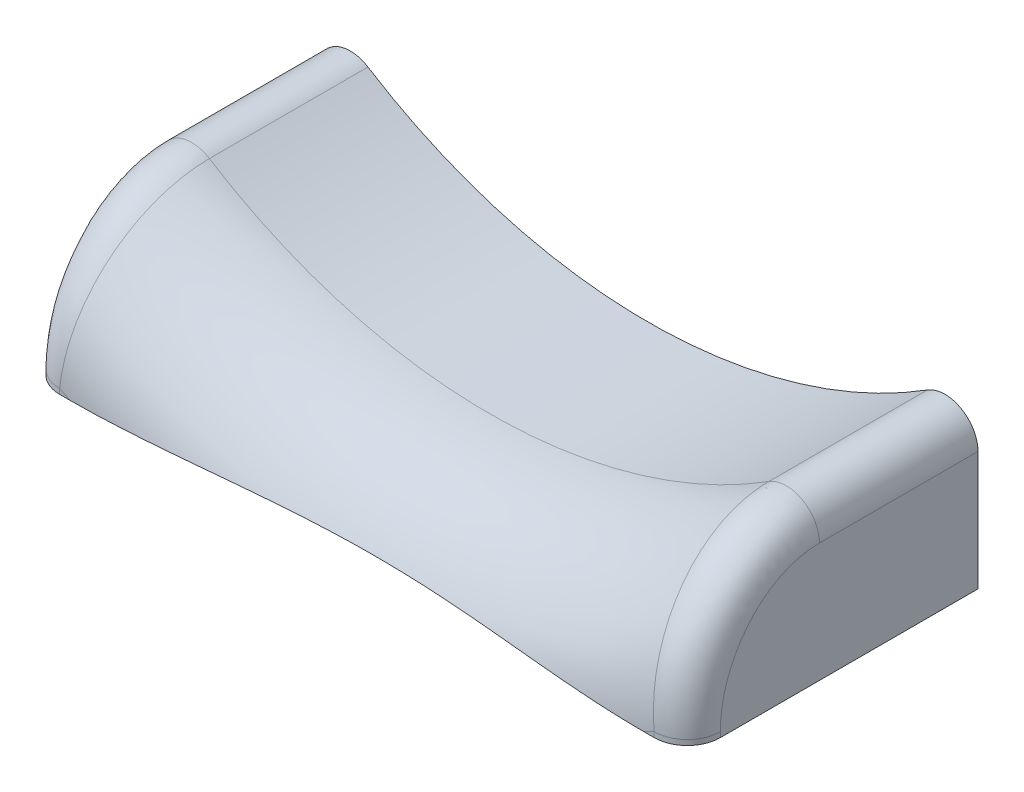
ISO-10303-21;
HEADER;
FILE_DESCRIPTION(('STEP AP214'),'2;1');
FILE_NAME('part.step','',(''),(''),'','','');
FILE_SCHEMA(('AUTOMOTIVE_DESIGN { 1 0 10303 214 1 1 1 1 }'));
ENDSEC;
DATA;
#1=APPLICATION_CONTEXT('core data for automotive mechanical design processes');
#2=APPLICATION_PROTOCOL_DEFINITION('international standard','automotive_design',2000,#1);
#3=PRODUCT_CONTEXT('',#1,'mechanical');
#4=PRODUCT('Part','Part','',(#3));
#5=PRODUCT_RELATED_PRODUCT_CATEGORY('part','',(#4));
#6=PRODUCT_DEFINITION_FORMATION('','',#4);
#7=PRODUCT_DEFINITION_CONTEXT('part definition',#1,'design');
#8=PRODUCT_DEFINITION('design','',#6,#7);
#9=PRODUCT_DEFINITION_SHAPE('','',#8);
#10=(LENGTH_UNIT() NAMED_UNIT(*) SI_UNIT(.MILLI.,.METRE.));
#11=(NAMED_UNIT(*) PLANE_ANGLE_UNIT() SI_UNIT($,.RADIAN.));
#12=(NAMED_UNIT(*) SI_UNIT($,.STERADIAN.) SOLID_ANGLE_UNIT());
#13=UNCERTAINTY_MEASURE_WITH_UNIT(LENGTH_MEASURE(1.E-05),#10,'distance_accuracy_value','');
#14=(GEOMETRIC_REPRESENTATION_CONTEXT(3) GLOBAL_UNCERTAINTY_ASSIGNED_CONTEXT((#13)) GLOBAL_UNIT_ASSIGNED_CONTEXT((#10,
#11,#12)) REPRESENTATION_CONTEXT('',''));
#15=CARTESIAN_POINT('',(0.,0.,0.));
#16=DIRECTION('',(0.,0.,1.));
#17=DIRECTION('',(1.,0.,0.));
#18=AXIS2_PLACEMENT_3D('',#15,#16,#17);
#19=CARTESIAN_POINT('',(0.,0.,144.));
#20=DIRECTION('',(0.,0.,1.));
#21=DIRECTION('',(1.,0.,0.));
#22=AXIS2_PLACEMENT_3D('',#19,#20,#21);
#23=PLANE('',#22);
#24=DIRECTION('',(1.,0.,0.));
#25=VECTOR('',#24,1.);
#26=CARTESIAN_POINT('',(-50.,0.,144.));
#27=LINE('',#26,#25);
#28=CARTESIAN_POINT('',(43.4330354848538,0.,144.));
#29=VERTEX_POINT('',#28);
#30=CARTESIAN_POINT('',(45.,0.,144.));
#31=VERTEX_POINT('',#30);
#32=EDGE_CURVE('E145',#29,#31,#27,.T.);
#33=ORIENTED_EDGE('',*,*,#32,.T.);
#34=DIRECTION('',(0.,1.,0.));
#35=VECTOR('',#34,1.);
#36=CARTESIAN_POINT('',(45.,3.50332923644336,144.));
#37=LINE('',#36,#35);
#38=CARTESIAN_POINT('',(45.0000000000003,0.779087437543,144.));
#39=VERTEX_POINT('',#38);
#40=EDGE_CURVE('E289',#31,#39,#37,.T.);
#41=ORIENTED_EDGE('',*,*,#40,.T.);
#42=CARTESIAN_POINT('',(0.,89.3214285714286,144.));
#43=DIRECTION('',(0.,0.,1.));
#44=DIRECTION('',(1.,0.,0.));
#45=AXIS2_PLACEMENT_3D('',#42,#43,#44);
#46=CIRCLE('',#45,99.3214285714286);
#47=EDGE_CURVE('E215',#39,#29,#46,.F.);
#48=ORIENTED_EDGE('',*,*,#47,.T.);
#49=EDGE_LOOP('',(#33,#41,#48));
#50=FACE_BOUND('',#49,.T.);
#51=ADVANCED_FACE('F35',(#50),#23,.T.);
#52=CARTESIAN_POINT('',(0.,89.3214285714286,144.));
#53=DIRECTION('',(0.,0.,1.));
#54=DIRECTION('',(1.,0.,0.));
#55=AXIS2_PLACEMENT_3D('',#52,#53,#54);
#56=CIRCLE('',#55,99.3214285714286);
#57=CARTESIAN_POINT('',(-43.4330354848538,0.,144.));
#58=VERTEX_POINT('',#57);
#59=CARTESIAN_POINT('',(-45.,0.779087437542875,144.));
#60=VERTEX_POINT('',#59);
#61=EDGE_CURVE('E212',#58,#60,#56,.F.);
#62=ORIENTED_EDGE('',*,*,#61,.T.);
#63=DIRECTION('',(0.,-1.,0.));
#64=VECTOR('',#63,1.);
#65=CARTESIAN_POINT('',(-45.,0.,144.));
#66=LINE('',#65,#64);
#67=CARTESIAN_POINT('',(-45.,0.,144.));
#68=VERTEX_POINT('',#67);
#69=EDGE_CURVE('E279',#60,#68,#66,.T.);
#70=ORIENTED_EDGE('',*,*,#69,.T.);
#71=EDGE_CURVE('E205',#68,#58,#27,.T.);
#72=ORIENTED_EDGE('',*,*,#71,.T.);
#73=EDGE_LOOP('',(#62,#70,#72));
#74=FACE_BOUND('',#73,.T.);
#75=ADVANCED_FACE('F228',(#74),#23,.T.);
#76=CARTESIAN_POINT('',(0.,0.,0.));
#77=DIRECTION('',(0.,1.,0.));
#78=DIRECTION('',(0.,0.,1.));
#79=AXIS2_PLACEMENT_3D('',#76,#77,#78);
#80=PLANE('',#79);
#81=DIRECTION('',(0.,0.,-1.));
#82=VECTOR('',#81,1.);
#83=CARTESIAN_POINT('',(-50.,0.,144.));
#84=LINE('',#83,#82);
#85=CARTESIAN_POINT('',(-50.,0.,139.));
#86=VERTEX_POINT('',#85);
#87=CARTESIAN_POINT('',(-50.,0.,100.));
#88=VERTEX_POINT('',#87);
#89=EDGE_CURVE('E209',#86,#88,#84,.T.);
#90=ORIENTED_EDGE('',*,*,#89,.T.);
#91=DIRECTION('',(1.,0.,0.));
#92=VECTOR('',#91,1.);
#93=CARTESIAN_POINT('',(0.,0.,100.));
#94=LINE('',#93,#92);
#95=CARTESIAN_POINT('',(50.,0.,100.));
#96=VERTEX_POINT('',#95);
#97=EDGE_CURVE('E201',#88,#96,#94,.T.);
#98=ORIENTED_EDGE('',*,*,#97,.T.);
#99=DIRECTION('',(0.,0.,-1.));
#100=VECTOR('',#99,1.);
#101=CARTESIAN_POINT('',(50.,0.,144.));
#102=LINE('',#101,#100);
#103=CARTESIAN_POINT('',(50.,0.,139.));
#104=VERTEX_POINT('',#103);
#105=EDGE_CURVE('E207',#104,#96,#102,.T.);
#106=ORIENTED_EDGE('',*,*,#105,.F.);
#107=CARTESIAN_POINT('',(45.,0.,139.));
#108=DIRECTION('',(0.,1.,0.));
#109=DIRECTION('',(0.,0.,1.));
#110=AXIS2_PLACEMENT_3D('',#107,#108,#109);
#111=CIRCLE('',#110,5.);
#112=EDGE_CURVE('E282',#104,#31,#111,.F.);
#113=ORIENTED_EDGE('',*,*,#112,.T.);
#114=ORIENTED_EDGE('',*,*,#32,.F.);
#115=CARTESIAN_POINT('',(43.4330354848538,0.,144.));
#116=CARTESIAN_POINT('',(42.5955665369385,0.,143.999979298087));
#117=CARTESIAN_POINT('',(41.7581600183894,0.,143.98994191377));
#118=CARTESIAN_POINT('',(40.0838489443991,0.,143.952500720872));
#119=CARTESIAN_POINT('',(39.2469443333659,0.,143.925099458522));
#120=CARTESIAN_POINT('',(37.5743629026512,0.,143.85562057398));
#121=CARTESIAN_POINT('',(36.7386856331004,0.,143.813553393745));
#122=CARTESIAN_POINT('',(35.0680080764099,0.,143.717270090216));
#123=CARTESIAN_POINT('',(34.2330078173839,0.,143.663053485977));
#124=CARTESIAN_POINT('',(31.7258605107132,0.,143.485679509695));
#125=CARTESIAN_POINT('',(30.0547599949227,0.,143.347949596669));
#126=CARTESIAN_POINT('',(26.7140567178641,0.,143.052940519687));
#127=CARTESIAN_POINT('',(25.0444543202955,0.,142.89565747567));
#128=CARTESIAN_POINT('',(21.7143748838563,0.,142.58107755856));
#129=CARTESIAN_POINT('',(20.0538974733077,0.,142.423785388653));
#130=CARTESIAN_POINT('',(17.5620922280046,0.,142.200308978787));
#131=CARTESIAN_POINT('',(16.7313318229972,0.,142.127895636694));
#132=CARTESIAN_POINT('',(15.0692982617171,0.,141.989248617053));
#133=CARTESIAN_POINT('',(14.2380251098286,0.,141.923014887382));
#134=CARTESIAN_POINT('',(12.576496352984,0.,141.798750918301));
#135=CARTESIAN_POINT('',(11.7462419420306,0.,141.740704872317));
#136=CARTESIAN_POINT('',(10.0851053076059,0.,141.634352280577));
#137=CARTESIAN_POINT('',(9.25422308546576,0.,141.586045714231));
#138=CARTESIAN_POINT('',(7.5918802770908,0.,141.500610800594));
#139=CARTESIAN_POINT('',(6.76041969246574,0.,141.463482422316));
#140=CARTESIAN_POINT('',(5.09703388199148,0.,141.401528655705));
#141=CARTESIAN_POINT('',(4.26510865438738,0.,141.376703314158));
#142=CARTESIAN_POINT('',(2.45868208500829,0.,141.337003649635));
#143=CARTESIAN_POINT('',(1.48412582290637,0.,141.324556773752));
#144=CARTESIAN_POINT('',(-0.465049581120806,0.,141.318137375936));
#145=CARTESIAN_POINT('',(-1.43966872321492,0.,141.324164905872));
#146=CARTESIAN_POINT('',(-3.3886175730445,0.,141.354433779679));
#147=CARTESIAN_POINT('',(-4.36294728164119,0.,141.378675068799));
#148=CARTESIAN_POINT('',(-6.31102028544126,0.,141.444343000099));
#149=CARTESIAN_POINT('',(-7.28476357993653,0.,141.48576966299));
#150=CARTESIAN_POINT('',(-9.23378933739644,0.,141.584197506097));
#151=CARTESIAN_POINT('',(-10.2090699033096,0.,141.641235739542));
#152=CARTESIAN_POINT('',(-12.1587600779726,0.,141.768506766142));
#153=CARTESIAN_POINT('',(-13.1331696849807,0.,141.838739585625));
#154=CARTESIAN_POINT('',(-15.0812881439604,0.,141.989605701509));
#155=CARTESIAN_POINT('',(-16.0549968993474,0.,142.070240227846));
#156=CARTESIAN_POINT('',(-18.0017838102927,0.,142.238748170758));
#157=CARTESIAN_POINT('',(-18.9748619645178,0.,142.32662160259));
#158=CARTESIAN_POINT('',(-21.9050449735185,0.,142.597117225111));
#159=CARTESIAN_POINT('',(-23.861585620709,0.,142.785644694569));
#160=CARTESIAN_POINT('',(-27.7754992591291,0.,143.149106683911));
#161=CARTESIAN_POINT('',(-29.7328718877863,0.,143.324044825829));
#162=CARTESIAN_POINT('',(-32.6682049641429,0.,143.553047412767));
#163=CARTESIAN_POINT('',(-33.6448344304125,0.,143.623720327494));
#164=CARTESIAN_POINT('',(-35.599013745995,0.,143.750170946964));
#165=CARTESIAN_POINT('',(-36.5765635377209,0.,143.805949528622));
#166=CARTESIAN_POINT('',(-38.5335158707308,0.,143.898654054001));
#167=CARTESIAN_POINT('',(-39.5129192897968,0.,143.935562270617));
#168=CARTESIAN_POINT('',(-41.4725223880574,0.,143.986219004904));
#169=CARTESIAN_POINT('',(-42.4527221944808,0.,143.999962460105));
#170=CARTESIAN_POINT('',(-43.4330354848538,0.,144.));
#171=B_SPLINE_CURVE_WITH_KNOTS('',3,(#115,#116,#117,#118,#119,#120,#121,#122,#123,#124,#125,
#126,#127,#128,#129,#130,#131,#132,#133,#134,#135,#136,#137,#138,#139,#140,#141,#142,#143,#144,
#145,#146,#147,#148,#149,#150,#151,#152,#153,#154,#155,#156,#157,#158,#159,#160,#161,#162,#163,
#164,#165,#166,#167,#168,#169,#170),.UNSPECIFIED.,.F.,.F.,(4,2,2,2,2,2,2,2,2,2,2,2,2,2,2,2,2,2,
2,2,2,2,2,2,2,2,2,4),(0.,2.51225722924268,5.02414614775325,7.53425027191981,10.0444537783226,
15.0744479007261,20.1054417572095,25.109144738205,27.6108586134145,30.1125513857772,
32.6093464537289,35.1061362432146,37.6029191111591,40.0997114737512,43.023442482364,
45.9471816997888,48.8709121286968,51.7946460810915,54.7253804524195,57.6561206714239,
60.5872077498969,63.5183010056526,69.415146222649,75.3104142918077,78.2478723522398,
81.1851574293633,84.1251967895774,87.0658785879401),.UNSPECIFIED.);
#172=EDGE_CURVE('E217',#29,#58,#171,.T.);
#173=ORIENTED_EDGE('',*,*,#172,.T.);
#174=ORIENTED_EDGE('',*,*,#71,.F.);
#175=CARTESIAN_POINT('',(-45.,0.,139.));
#176=DIRECTION('',(0.,1.,0.));
#177=DIRECTION('',(0.,0.,1.));
#178=AXIS2_PLACEMENT_3D('',#175,#176,#177);
#179=CIRCLE('',#178,5.);
#180=EDGE_CURVE('E284',#68,#86,#179,.F.);
#181=ORIENTED_EDGE('',*,*,#180,.T.);
#182=EDGE_LOOP('',(#90,#98,#106,#113,#114,#173,#174,#181));
#183=FACE_BOUND('',#182,.T.);
#184=ADVANCED_FACE('F225',(#183),#80,.F.);
#185=CARTESIAN_POINT('',(-50.,24.,144.));
#186=DIRECTION('',(1.,0.,0.));
#187=DIRECTION('',(0.,0.,-1.));
#188=AXIS2_PLACEMENT_3D('',#185,#186,#187);
#189=PLANE('',#188);
#190=DIRECTION('',(0.,0.,1.));
#191=VECTOR('',#190,1.);
#192=CARTESIAN_POINT('',(-50.,18.0115182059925,134.437685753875));
#193=LINE('',#192,#191);
#194=CARTESIAN_POINT('',(-50.,18.0115182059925,124.));
#195=VERTEX_POINT('',#194);
#196=CARTESIAN_POINT('',(-50.,18.0115182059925,100.));
#197=VERTEX_POINT('',#196);
#198=EDGE_CURVE('E277',#195,#197,#193,.F.);
#199=ORIENTED_EDGE('',*,*,#198,.T.);
#200=DIRECTION('',(0.,-1.,0.));
#201=VECTOR('',#200,1.);
#202=CARTESIAN_POINT('',(-50.,24.,100.));
#203=LINE('',#202,#201);
#204=EDGE_CURVE('E49',#197,#88,#203,.T.);
#205=ORIENTED_EDGE('',*,*,#204,.T.);
#206=ORIENTED_EDGE('',*,*,#89,.F.);
#207=DIRECTION('',(0.,-1.,0.));
#208=VECTOR('',#207,1.);
#209=CARTESIAN_POINT('',(-50.,3.50332923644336,139.));
#210=LINE('',#209,#208);
#211=CARTESIAN_POINT('',(-50.,0.77908743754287,139.));
#212=VERTEX_POINT('',#211);
#213=EDGE_CURVE('E270',#86,#212,#210,.F.);
#214=ORIENTED_EDGE('',*,*,#213,.T.);
#215=CARTESIAN_POINT('',(-45.8181137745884,-7.32911408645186,142.483478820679));
#216=CARTESIAN_POINT('',(-47.6276561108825,-7.22410936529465,142.202319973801));
#217=CARTESIAN_POINT('',(-48.8138280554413,-6.7346053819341,140.891632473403));
#218=CARTESIAN_POINT('',(-50.,-6.24510139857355,139.580944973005));
#219=CARTESIAN_POINT('',(-50.,-5.60335250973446,137.862609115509));
#220=CARTESIAN_POINT('',(-45.7637728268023,-6.76086889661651,142.705358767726));
#221=CARTESIAN_POINT('',(-47.5919990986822,-6.66903886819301,142.437857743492));
#222=CARTESIAN_POINT('',(-48.7960174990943,-6.21392808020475,141.108540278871));
#223=CARTESIAN_POINT('',(-50.,-5.75774983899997,139.77968248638));
#224=CARTESIAN_POINT('',(-50.,-5.15784862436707,138.029019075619));
#225=CARTESIAN_POINT('',(-45.7080440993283,-6.18445640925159,142.902873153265));
#226=CARTESIAN_POINT('',(-47.5552139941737,-6.10534533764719,142.650496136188));
#227=CARTESIAN_POINT('',(-48.7776274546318,-5.68468511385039,141.304365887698));
#228=CARTESIAN_POINT('',(-50.,-5.26286236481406,139.958618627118));
#229=CARTESIAN_POINT('',(-50.,-4.70558861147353,138.177154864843));
#230=CARTESIAN_POINT('',(-45.5940785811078,-5.01921611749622,143.24918971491));
#231=CARTESIAN_POINT('',(-47.4794123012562,-4.96322817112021,143.030407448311));
#232=CARTESIAN_POINT('',(-48.7397266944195,-4.6123095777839,141.653679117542));
#233=CARTESIAN_POINT('',(-50.,-4.26023331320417,140.277323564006));
#234=CARTESIAN_POINT('',(-50.,-3.79055133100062,138.436892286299));
#235=CARTESIAN_POINT('',(-45.5358411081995,-4.4303849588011,143.39797854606));
#236=CARTESIAN_POINT('',(-47.440385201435,-4.38469231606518,143.197594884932));
#237=CARTESIAN_POINT('',(-48.7202156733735,-4.06917324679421,141.807155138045));
#238=CARTESIAN_POINT('',(-50.,-3.75239341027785,140.417017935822));
#239=CARTESIAN_POINT('',(-50.,-3.32777121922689,138.548483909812));
#240=CARTESIAN_POINT('',(-45.4176337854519,-3.24931938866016,143.645739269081));
#241=CARTESIAN_POINT('',(-47.3605196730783,-3.22136486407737,143.485086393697));
#242=CARTESIAN_POINT('',(-48.6802825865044,-2.9769593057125,142.070411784));
#243=CARTESIAN_POINT('',(-50.,-2.73130792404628,140.656038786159));
#244=CARTESIAN_POINT('',(-50.,-2.39869402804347,138.734304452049));
#245=CARTESIAN_POINT('',(-45.3576816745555,-2.65715062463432,143.745102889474));
#246=CARTESIAN_POINT('',(-47.3196876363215,-2.63655039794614,143.605675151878));
#247=CARTESIAN_POINT('',(-48.6598691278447,-2.42796482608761,142.180534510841));
#248=CARTESIAN_POINT('',(-50.,-2.21804177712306,140.755609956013));
#249=CARTESIAN_POINT('',(-50.,-1.93245532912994,138.808827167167));
#250=CARTESIAN_POINT('',(-45.2359099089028,-1.46869321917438,143.895993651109));
#251=CARTESIAN_POINT('',(-47.2360288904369,-1.45960356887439,143.801750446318));
#252=CARTESIAN_POINT('',(-48.6180397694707,-1.32305982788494,142.358750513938));
#253=CARTESIAN_POINT('',(-50.,-1.18517861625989,140.915965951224));
#254=CARTESIAN_POINT('',(-50.,-0.995842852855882,138.921995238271));
#255=CARTESIAN_POINT('',(-45.174091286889,-0.872406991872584,143.947546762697));
#256=CARTESIAN_POINT('',(-47.1931930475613,-0.867381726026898,143.877164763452));
#257=CARTESIAN_POINT('',(-48.5966244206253,-0.767153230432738,142.426866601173));
#258=CARTESIAN_POINT('',(-50.,-0.665503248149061,140.976688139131));
#259=CARTESIAN_POINT('',(-50.,-0.525471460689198,138.960660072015));
#260=CARTESIAN_POINT('',(-45.0930501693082,-0.100117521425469,143.983604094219));
#261=CARTESIAN_POINT('',(-47.1365677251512,-0.0987021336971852,143.945576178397));
#262=CARTESIAN_POINT('',(-48.5682862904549,-0.0449377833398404,142.487899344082));
#263=CARTESIAN_POINT('',(-50.,0.00895045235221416,141.030233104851));
#264=CARTESIAN_POINT('',(-50.,0.0843482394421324,138.987703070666));
#265=CARTESIAN_POINT('',(-45.0745375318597,0.0756771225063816,143.989752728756));
#266=CARTESIAN_POINT('',(-47.123585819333,0.0765902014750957,143.959198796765));
#267=CARTESIAN_POINT('',(-48.5617954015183,0.119607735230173,142.499969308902));
#268=CARTESIAN_POINT('',(-50.,0.162750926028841,141.040747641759));
#269=CARTESIAN_POINT('',(-50.,0.223201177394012,138.992314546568));
#270=CARTESIAN_POINT('',(-45.0373709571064,0.427355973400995,143.997952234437));
#271=CARTESIAN_POINT('',(-47.0974509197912,0.427594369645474,143.98253871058));
#272=CARTESIAN_POINT('',(-48.5487279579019,0.449089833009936,142.520479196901));
#273=CARTESIAN_POINT('',(-50.,0.470711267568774,141.058427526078));
#274=CARTESIAN_POINT('',(-50.,0.501060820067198,138.998464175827));
#275=CARTESIAN_POINT('',(-45.0187169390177,0.603240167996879,144.000000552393));
#276=CARTESIAN_POINT('',(-47.0842975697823,0.603308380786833,143.992250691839));
#277=CARTESIAN_POINT('',(-48.5421513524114,0.61402659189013,142.528916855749));
#278=CARTESIAN_POINT('',(-50.,0.624873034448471,141.065588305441));
#279=CARTESIAN_POINT('',(-50.,0.640067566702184,139.000000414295));
#280=CARTESIAN_POINT('',(-44.9283148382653,1.45257576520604,143.999997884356));
#281=CARTESIAN_POINT('',(-47.020303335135,1.45357686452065,144.02973520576));
#282=CARTESIAN_POINT('',(-48.5101893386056,1.41126417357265,142.560876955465));
#283=CARTESIAN_POINT('',(-50.,1.37083019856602,141.092093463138));
#284=CARTESIAN_POINT('',(-50.,1.31152823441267,138.999998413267));
#285=CARTESIAN_POINT('',(-44.8557067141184,2.12552245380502,143.969941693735));
#286=CARTESIAN_POINT('',(-46.968408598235,2.12909329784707,144.030574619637));
#287=CARTESIAN_POINT('',(-48.4842456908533,2.0452610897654,142.559514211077));
#288=CARTESIAN_POINT('',(-50.,1.96340875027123,141.088365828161));
#289=CARTESIAN_POINT('',(-50.,1.84416154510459,138.97745627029));
#290=CARTESIAN_POINT('',(-44.7091399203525,3.4653185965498,143.850401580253));
#291=CARTESIAN_POINT('',(-46.862438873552,3.47950082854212,143.974841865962));
#292=CARTESIAN_POINT('',(-48.4312610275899,3.31269518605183,142.503397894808));
#293=CARTESIAN_POINT('',(-50.,3.14787968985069,141.031866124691));
#294=CARTESIAN_POINT('',(-50.,2.90590134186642,138.887801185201));
#295=CARTESIAN_POINT('',(-44.6351803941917,4.13216375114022,143.760878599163));
#296=CARTESIAN_POINT('',(-46.8083482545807,4.1544830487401,143.918047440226));
#297=CARTESIAN_POINT('',(-48.4042193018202,3.94613172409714,142.448609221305));
#298=CARTESIAN_POINT('',(-50.,3.73985147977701,140.978903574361));
#299=CARTESIAN_POINT('',(-50.,3.43500527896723,138.820658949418));
#300=CARTESIAN_POINT('',(-44.4862847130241,5.4563426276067,143.522906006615));
#301=CARTESIAN_POINT('',(-46.6981095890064,5.50093970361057,143.74675307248));
#302=CARTESIAN_POINT('',(-48.3491002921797,5.20971456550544,142.285428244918));
#303=CARTESIAN_POINT('',(-50.,4.92057560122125,140.823833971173));
#304=CARTESIAN_POINT('',(-50.,4.48700980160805,138.642179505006));
#305=CARTESIAN_POINT('',(-44.4113466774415,6.11365043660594,143.374318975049));
#306=CARTESIAN_POINT('',(-46.6419437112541,6.17246985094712,143.63191692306));
#307=CARTESIAN_POINT('',(-48.3210207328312,5.83984969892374,142.176910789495));
#308=CARTESIAN_POINT('',(-50.,5.50937597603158,140.721440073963));
#309=CARTESIAN_POINT('',(-50.,5.00989297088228,138.530739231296));
#310=CARTESIAN_POINT('',(-44.2612586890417,7.41233869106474,143.019127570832));
#311=CARTESIAN_POINT('',(-46.5279822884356,7.50601883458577,143.344333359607));
#312=CARTESIAN_POINT('',(-48.2640401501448,7.09117885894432,141.90615657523));
#313=CARTESIAN_POINT('',(-50.,6.67849160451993,140.467514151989));
#314=CARTESIAN_POINT('',(-50.,6.04436045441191,138.264345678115));
#315=CARTESIAN_POINT('',(-44.1861087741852,8.05372180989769,142.812533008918));
#316=CARTESIAN_POINT('',(-46.4701746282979,8.16808576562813,143.171379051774));
#317=CARTESIAN_POINT('',(-48.2351392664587,7.71237437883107,141.743928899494));
#318=CARTESIAN_POINT('',(-50.,7.25884854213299,140.315805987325));
#319=CARTESIAN_POINT('',(-50.,6.55594666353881,138.109399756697));
#320=CARTESIAN_POINT('',(-44.0361834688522,9.31635941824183,142.342108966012));
#321=CARTESIAN_POINT('',(-46.3532611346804,9.47882528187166,142.76713740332));
#322=CARTESIAN_POINT('',(-48.1766827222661,8.94215422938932,141.365438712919));
#323=CARTESIAN_POINT('',(-50.,8.40767794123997,139.963064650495));
#324=CARTESIAN_POINT('',(-50.,7.56443590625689,137.7565817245));
#325=CARTESIAN_POINT('',(-43.96140830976,9.93760252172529,142.07824773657));
#326=CARTESIAN_POINT('',(-46.2941444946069,10.1275034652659,142.535590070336));
#327=CARTESIAN_POINT('',(-48.1471267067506,9.55073135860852,141.14914621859));
#328=CARTESIAN_POINT('',(-50.,8.97615471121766,139.761811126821));
#329=CARTESIAN_POINT('',(-50.,8.06133062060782,137.558685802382));
#330=CARTESIAN_POINT('',(-43.8130021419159,11.1547386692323,141.494366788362));
#331=CARTESIAN_POINT('',(-46.1751285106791,11.4063668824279,142.013770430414));
#332=CARTESIAN_POINT('',(-48.0876188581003,10.7504654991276,140.662244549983));
#333=CARTESIAN_POINT('',(-50.,10.096766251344,139.30982518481));
#334=CARTESIAN_POINT('',(-50.,9.03619272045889,137.120775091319));
#335=CARTESIAN_POINT('',(-43.7393710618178,11.7506332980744,141.174350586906));
#336=CARTESIAN_POINT('',(-46.1152221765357,12.0365299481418,141.723267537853));
#337=CARTESIAN_POINT('',(-48.057667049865,11.341623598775,140.391638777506));
#338=CARTESIAN_POINT('',(-50.,10.6488810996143,139.058898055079));
#339=CARTESIAN_POINT('',(-50.,9.51416128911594,136.880762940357));
#340=CARTESIAN_POINT('',(-43.5940553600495,12.912163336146,140.47921845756));
#341=CARTESIAN_POINT('',(-45.9952319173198,13.2733450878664,141.082921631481));
#342=CARTESIAN_POINT('',(-47.9976720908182,12.5017821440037,139.795623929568));
#343=CARTESIAN_POINT('',(-50.,11.7323906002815,138.507211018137));
#344=CARTESIAN_POINT('',(-50.,10.4471232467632,136.359413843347));
#345=CARTESIAN_POINT('',(-43.5223709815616,13.4777949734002,140.104095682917));
#346=CARTESIAN_POINT('',(-45.9351454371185,13.8799252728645,140.732838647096));
#347=CARTESIAN_POINT('',(-47.9676289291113,13.07077982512,139.470208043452));
#348=CARTESIAN_POINT('',(-50.,12.2637217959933,138.206249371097));
#349=CARTESIAN_POINT('',(-50.,10.9021137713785,136.078071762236));
#350=CARTESIAN_POINT('',(-43.3819239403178,14.5730517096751,139.300347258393));
#351=CARTESIAN_POINT('',(-45.8156252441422,15.0633287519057,139.973006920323));
#352=CARTESIAN_POINT('',(-47.907868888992,14.1807284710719,138.764354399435));
#353=CARTESIAN_POINT('',(-50.,13.3002189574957,137.554372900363));
#354=CARTESIAN_POINT('',(-50.,11.7843438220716,135.475260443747));
#355=CARTESIAN_POINT('',(-43.3131594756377,15.1026991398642,138.871755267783));
#356=CARTESIAN_POINT('',(-45.756194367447,15.6400506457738,139.563075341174));
#357=CARTESIAN_POINT('',(-47.8781518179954,14.7216967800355,138.383951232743));
#358=CARTESIAN_POINT('',(-50.,13.8052957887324,137.203305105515));
#359=CARTESIAN_POINT('',(-50.,12.2116005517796,135.153816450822));
#360=CARTESIAN_POINT('',(-43.1825229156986,16.0979585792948,137.9828538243));
#361=CARTESIAN_POINT('',(-45.6415633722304,16.7324651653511,138.70269467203));
#362=CARTESIAN_POINT('',(-47.8208317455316,15.7463032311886,137.585900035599));
#363=CARTESIAN_POINT('',(-50.,14.7619312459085,136.467712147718));
#364=CARTESIAN_POINT('',(-50.,13.0155295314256,134.48714036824));
#365=CARTESIAN_POINT('',(-43.1204802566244,16.565371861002,137.524806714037));
#366=CARTESIAN_POINT('',(-45.5862932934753,17.249656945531,138.254625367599));
#367=CARTESIAN_POINT('',(-47.7931935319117,16.2314216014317,137.170664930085));
#368=CARTESIAN_POINT('',(-50.,15.2148056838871,136.085174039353));
#369=CARTESIAN_POINT('',(-50.,13.3936071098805,134.143605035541));
#370=CARTESIAN_POINT('',(-43.0009726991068,17.4571196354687,136.563202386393));
#371=CARTESIAN_POINT('',(-45.4782855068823,18.2444235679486,137.303601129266));
#372=CARTESIAN_POINT('',(-47.7391897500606,17.1643127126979,136.289729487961));
#373=CARTESIAN_POINT('',(-50.,16.0858259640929,135.274325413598));
#374=CARTESIAN_POINT('',(-50.,14.115793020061,133.422401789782));
#375=CARTESIAN_POINT('',(-42.9435078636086,17.8814535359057,136.05964454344));
#376=CARTESIAN_POINT('',(-45.4255645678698,18.7217868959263,136.800523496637));
#377=CARTESIAN_POINT('',(-47.7128241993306,17.612084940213,135.824028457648));
#378=CARTESIAN_POINT('',(-50.,16.5037864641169,134.845913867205));
#379=CARTESIAN_POINT('',(-50.,14.4599008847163,133.044733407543));
#380=CARTESIAN_POINT('',(-42.8343277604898,18.6807955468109,135.010413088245));
#381=CARTESIAN_POINT('',(-45.3239985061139,19.6285339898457,135.741165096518));
#382=CARTESIAN_POINT('',(-47.6620412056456,18.4624081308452,134.843778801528));
#383=CARTESIAN_POINT('',(-50.,17.2976874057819,133.94477430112));
#384=CARTESIAN_POINT('',(-50.,15.1088436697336,132.257809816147));
#385=CARTESIAN_POINT('',(-42.7826049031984,19.0558688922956,134.464796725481));
#386=CARTESIAN_POINT('',(-45.2751724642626,20.0577210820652,135.184899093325));
#387=CARTESIAN_POINT('',(-47.637621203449,18.8650187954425,134.329296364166));
#388=CARTESIAN_POINT('',(-50.,17.6734556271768,133.472060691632));
#389=CARTESIAN_POINT('',(-50.,15.413730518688,131.848597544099));
#390=CARTESIAN_POINT('',(-42.6859816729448,19.7514051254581,133.334536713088));
#391=CARTESIAN_POINT('',(-45.182781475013,20.8601424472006,134.020981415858));
#392=CARTESIAN_POINT('',(-47.5914258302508,19.6175068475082,133.253220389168));
#393=CARTESIAN_POINT('',(-50.,18.3760147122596,132.483828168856));
#394=CARTESIAN_POINT('',(-50.,15.9796752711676,131.000902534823));
#395=CARTESIAN_POINT('',(-42.6410797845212,20.0718801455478,132.749901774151));
#396=CARTESIAN_POINT('',(-45.1392467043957,21.233085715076,133.413378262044));
#397=CARTESIAN_POINT('',(-47.5696498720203,19.9673959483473,132.691637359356));
#398=CARTESIAN_POINT('',(-50.,18.7025508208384,131.968352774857));
#399=CARTESIAN_POINT('',(-50.,16.2407429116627,130.562426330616));
#400=CARTESIAN_POINT('',(-42.5649517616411,20.611966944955,131.630262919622));
#401=CARTESIAN_POINT('',(-45.0646137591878,21.8662673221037,132.23928467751));
#402=CARTESIAN_POINT('',(-47.532326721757,20.5613004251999,131.606686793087));
#403=CARTESIAN_POINT('',(-50.,19.2569644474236,130.972936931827));
#404=CARTESIAN_POINT('',(-50.,16.6810794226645,129.722697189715));
#405=CARTESIAN_POINT('',(-42.532692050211,20.8394087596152,131.099674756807));
#406=CARTESIAN_POINT('',(-45.0326410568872,22.1348432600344,131.678760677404));
#407=CARTESIAN_POINT('',(-47.5163344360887,20.8132734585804,131.088877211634));
#408=CARTESIAN_POINT('',(-50.,19.4921390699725,130.497968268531));
#409=CARTESIAN_POINT('',(-50.,16.8666757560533,129.324756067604));
#410=CARTESIAN_POINT('',(-42.4747830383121,21.2459972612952,130.017070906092));
#411=CARTESIAN_POINT('',(-44.9747754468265,22.6177332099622,130.527216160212));
#412=CARTESIAN_POINT('',(-47.4874017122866,21.266144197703,130.025419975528));
#413=CARTESIAN_POINT('',(-50.,19.9149930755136,129.522598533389));
#414=CARTESIAN_POINT('',(-50.,17.1986534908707,128.512803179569));
#415=CARTESIAN_POINT('',(-42.449133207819,21.4251478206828,129.465056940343));
#416=CARTESIAN_POINT('',(-44.9489054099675,22.8318498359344,129.936370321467));
#417=CARTESIAN_POINT('',(-47.4744610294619,21.4670459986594,129.479774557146));
#418=CARTESIAN_POINT('',(-50.,20.1024996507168,129.022346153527));
#419=CARTESIAN_POINT('',(-50.,17.3450380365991,128.098792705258));
#420=CARTESIAN_POINT('',(-42.4050791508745,21.7319300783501,128.344787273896));
#421=CARTESIAN_POINT('',(-44.9041949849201,23.2001852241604,128.730634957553));
#422=CARTESIAN_POINT('',(-47.4521059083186,21.8124989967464,128.36662487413));
#423=CARTESIAN_POINT('',(-50.,20.4250726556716,128.001780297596));
#424=CARTESIAN_POINT('',(-50.,17.5958178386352,127.258590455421));
#425=CARTESIAN_POINT('',(-42.3866689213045,21.8596044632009,127.776545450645));
#426=CARTESIAN_POINT('',(-44.8853697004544,23.3542782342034,128.116010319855));
#427=CARTESIAN_POINT('',(-47.4426885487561,21.9570968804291,127.799139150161));
#428=CARTESIAN_POINT('',(-50.,20.5600289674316,127.481691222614));
#429=CARTESIAN_POINT('',(-50.,17.7002478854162,126.832409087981));
#430=CARTESIAN_POINT('',(-42.3575450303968,22.0612313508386,126.62887245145));
#431=CARTESIAN_POINT('',(-44.8554714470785,23.5983597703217,126.869819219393));
#432=CARTESIAN_POINT('',(-47.4277395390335,22.1860238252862,126.64888087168));
#433=CARTESIAN_POINT('',(-50.,20.7738045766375,126.427362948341));
#434=CARTESIAN_POINT('',(-50.,17.8652078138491,125.971654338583));
#435=CARTESIAN_POINT('',(-42.346830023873,22.1351932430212,126.049443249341));
#436=CARTESIAN_POINT('',(-44.8444127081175,23.6882314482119,126.238563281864));
#437=CARTESIAN_POINT('',(-47.422207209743,22.2703634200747,126.066111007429));
#438=CARTESIAN_POINT('',(-50.,20.8525215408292,125.89338661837));
#439=CARTESIAN_POINT('',(-50.,17.9257453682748,125.537082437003));
#440=CARTESIAN_POINT('',(-42.3343731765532,22.2211372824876,124.97112085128));
#441=CARTESIAN_POINT('',(-44.8315374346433,23.7927889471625,125.061498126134));
#442=CARTESIAN_POINT('',(-47.4157692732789,22.36843723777,124.979744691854));
#443=CARTESIAN_POINT('',(-50.,20.9441024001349,124.89778940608));
#444=CARTESIAN_POINT('',(-50.,17.9960951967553,124.728340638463));
#445=CARTESIAN_POINT('',(-42.3315427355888,22.2406397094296,124.47292651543));
#446=CARTESIAN_POINT('',(-44.828605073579,23.8165540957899,124.516987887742));
#447=CARTESIAN_POINT('',(-47.4143025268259,22.3907364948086,124.477120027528));
#448=CARTESIAN_POINT('',(-50.,20.9649185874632,124.437256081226));
#449=CARTESIAN_POINT('',(-50.,18.0120620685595,124.35469488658));
#450=CARTESIAN_POINT('',(-42.3317405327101,22.2392766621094,123.476640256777));
#451=CARTESIAN_POINT('',(-44.828809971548,23.8148931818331,123.427884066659));
#452=CARTESIAN_POINT('',(-47.4144049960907,22.3891783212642,123.471999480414));
#453=CARTESIAN_POINT('',(-50.,20.9634637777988,123.516117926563));
#454=CARTESIAN_POINT('',(-50.,18.0109461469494,123.607480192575));
#455=CARTESIAN_POINT('',(-42.3347682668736,22.2184146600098,122.97854832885));
#456=CARTESIAN_POINT('',(-44.8319466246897,23.7894720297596,122.88351344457));
#457=CARTESIAN_POINT('',(-47.4159739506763,22.3653248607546,122.969503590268));
#458=CARTESIAN_POINT('',(-50.,20.9411970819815,123.055701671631));
#459=CARTESIAN_POINT('',(-50.,17.9938661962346,123.23391124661));
#460=CARTESIAN_POINT('',(-42.3466426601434,22.1364822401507,121.984668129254));
#461=CARTESIAN_POINT('',(-44.844218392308,23.6898025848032,121.79869249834));
#462=CARTESIAN_POINT('',(-47.4221098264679,22.2718405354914,121.968304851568));
#463=CARTESIAN_POINT('',(-50.,20.8538977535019,122.13812328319));
#464=CARTESIAN_POINT('',(-50.,17.9268009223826,122.488501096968));
#465=CARTESIAN_POINT('',(-42.3555077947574,22.0752841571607,121.488892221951));
#466=CARTESIAN_POINT('',(-44.8533675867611,23.615439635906,121.258476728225));
#467=CARTESIAN_POINT('',(-47.4266862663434,22.2020643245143,121.469619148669));
#468=CARTESIAN_POINT('',(-50.,20.7887646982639,121.681159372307));
#469=CARTESIAN_POINT('',(-50.,17.876711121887,122.116669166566));
#470=CARTESIAN_POINT('',(-42.3730433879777,21.9539468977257,120.751125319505));
#471=CARTESIAN_POINT('',(-44.8713917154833,23.4684129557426,120.456570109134));
#472=CARTESIAN_POINT('',(-47.4356964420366,22.0641936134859,120.729605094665));
#473=CARTESIAN_POINT('',(-50.,20.6599921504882,121.002740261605));
#474=CARTESIAN_POINT('',(-50.,17.7774322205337,121.563343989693));
#475=CARTESIAN_POINT('',(-42.3795964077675,21.9085673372,120.50614379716));
#476=CARTESIAN_POINT('',(-44.878114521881,23.4135063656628,120.190743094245));
#477=CARTESIAN_POINT('',(-47.439058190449,22.0126904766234,120.484227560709));
#478=CARTESIAN_POINT('',(-50.,20.6119031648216,120.777832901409));
#479=CARTESIAN_POINT('',(-50.,17.7403066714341,121.379607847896));
#480=CARTESIAN_POINT('',(-42.3940822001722,21.8081239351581,120.018556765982));
#481=CARTESIAN_POINT('',(-44.8929396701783,23.2921848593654,119.662569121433));
#482=CARTESIAN_POINT('',(-47.4464707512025,21.89890238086,119.996685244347));
#483=CARTESIAN_POINT('',(-50.,20.5056479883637,120.330923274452));
#484=CARTESIAN_POINT('',(-50.,17.6581481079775,121.013917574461));
#485=CARTESIAN_POINT('',(-42.4020149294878,21.7530603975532,119.775951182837));
#486=CARTESIAN_POINT('',(-44.9010405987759,23.2257816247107,119.400244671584));
#487=CARTESIAN_POINT('',(-47.4505215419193,21.8366177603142,119.754520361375));
#488=CARTESIAN_POINT('',(-50.,20.4474920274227,120.108940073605));
#489=CARTESIAN_POINT('',(-50.,17.6131153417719,120.83196338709));
#490=CARTESIAN_POINT('',(-42.4106211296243,21.6932357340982,119.534716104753));
#491=CARTESIAN_POINT('',(-44.9098076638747,23.1537568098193,119.139851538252));
#492=CARTESIAN_POINT('',(-47.4549038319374,21.7690854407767,119.514209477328));
#493=CARTESIAN_POINT('',(-50.,20.3844140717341,119.888567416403));
#494=CARTESIAN_POINT('',(-50.,17.5641989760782,120.651037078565));
#495=(BOUNDED_SURFACE() B_SPLINE_SURFACE(3,2,((#215,#216,#217,#218,#219),(#220,#221,#222,#223,
#224),(#225,#226,#227,#228,#229),(#230,#231,#232,#233,#234),(#235,#236,#237,#238,#239),(#240,
#241,#242,#243,#244),(#245,#246,#247,#248,#249),(#250,#251,#252,#253,#254),(#255,#256,#257,#258,
#259),(#260,#261,#262,#263,#264),(#265,#266,#267,#268,#269),(#270,#271,#272,#273,#274),(#275,
#276,#277,#278,#279),(#280,#281,#282,#283,#284),(#285,#286,#287,#288,#289),(#290,#291,#292,#293,
#294),(#295,#296,#297,#298,#299),(#300,#301,#302,#303,#304),(#305,#306,#307,#308,#309),(#310,
#311,#312,#313,#314),(#315,#316,#317,#318,#319),(#320,#321,#322,#323,#324),(#325,#326,#327,#328,
#329),(#330,#331,#332,#333,#334),(#335,#336,#337,#338,#339),(#340,#341,#342,#343,#344),(#345,
#346,#347,#348,#349),(#350,#351,#352,#353,#354),(#355,#356,#357,#358,#359),(#360,#361,#362,#363,
#364),(#365,#366,#367,#368,#369),(#370,#371,#372,#373,#374),(#375,#376,#377,#378,#379),(#380,
#381,#382,#383,#384),(#385,#386,#387,#388,#389),(#390,#391,#392,#393,#394),(#395,#396,#397,#398,
#399),(#400,#401,#402,#403,#404),(#405,#406,#407,#408,#409),(#410,#411,#412,#413,#414),(#415,
#416,#417,#418,#419),(#420,#421,#422,#423,#424),(#425,#426,#427,#428,#429),(#430,#431,#432,#433,
#434),(#435,#436,#437,#438,#439),(#440,#441,#442,#443,#444),(#445,#446,#447,#448,#449),(#450,
#451,#452,#453,#454),(#455,#456,#457,#458,#459),(#460,#461,#462,#463,#464),(#465,#466,#467,#468,
#469),(#470,#471,#472,#473,#474),(#475,#476,#477,#478,#479),(#480,#481,#482,#483,#484),(#485,
#486,#487,#488,#489),(#490,#491,#492,#493,#494)),.UNSPECIFIED.,.F.,.F.,
.F.) B_SPLINE_SURFACE_WITH_KNOTS((4,2,2,2,2,2,2,2,2,2,2,2,2,2,2,2,2,2,2,2,2,2,2,2,2,2,2,4),(3,2,
3),(0.,1.42622211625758,2.85283452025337,4.26795234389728,5.6823010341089,6.09906676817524,
6.51609193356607,8.11328239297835,9.71152293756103,11.3135039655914,12.9152142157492,
14.5178147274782,16.1203148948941,17.7230143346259,19.3247099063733,20.8550796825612,
22.3854704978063,23.9138137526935,25.4418169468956,26.7571743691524,28.0724262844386,
29.3865852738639,30.7005144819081,31.8210510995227,32.9414913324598,34.0654949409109,
34.6276921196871,35.1898716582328),(0.,0.5,1.),
.UNSPECIFIED.) GEOMETRIC_REPRESENTATION_ITEM() RATIONAL_B_SPLINE_SURFACE(((1.,0.938819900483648,
1.,0.938819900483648,1.),(1.,0.937871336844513,1.,0.937871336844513,1.),(1.,0.936890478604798,
1.,0.936890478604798,1.),(1.,0.934865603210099,1.,0.934865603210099,1.),(1.,0.933821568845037,
1.,0.933821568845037,1.),(1.,0.931680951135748,1.,0.931680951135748,1.),(1.,0.930584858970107,
1.,0.930584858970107,1.),(1.,0.928334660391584,1.,0.928334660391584,1.),(1.,0.927180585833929,
1.,0.927180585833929,1.),(1.,0.92565044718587,1.,0.92565044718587,1.),(1.,0.925299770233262,1.,
0.925299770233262,1.),(1.,0.924593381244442,1.,0.924593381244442,1.),(1.,0.924237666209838,1.,
0.924237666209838,1.),(1.,0.922507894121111,1.,0.922507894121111,1.),(1.,0.921100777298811,1.,
0.921100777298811,1.),(1.,0.918220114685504,1.,0.918220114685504,1.),(1.,0.916746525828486,1.,
0.916746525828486,1.),(1.,0.913735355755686,1.,0.913735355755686,1.),(1.,0.912197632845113,1.,
0.912197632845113,1.),(1.,0.909069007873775,1.,0.909069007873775,1.),(1.,0.907478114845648,1.,
0.907478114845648,1.),(1.,0.904251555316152,1.,0.904251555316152,1.),(1.,0.902615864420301,1.,
0.902615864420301,1.),(1.,0.899313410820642,1.,0.899313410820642,1.),(1.,0.897646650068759,1.,
0.897646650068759,1.),(1.,0.894298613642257,1.,0.894298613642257,1.),(1.,0.89261733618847,1.,
0.89261733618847,1.),(1.,0.889263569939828,1.,0.889263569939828,1.),(1.,0.887591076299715,1.,
0.887591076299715,1.),(1.,0.884356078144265,1.,0.884356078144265,1.),(1.,0.882791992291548,1.,
0.882791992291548,1.),(1.,0.879727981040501,1.,0.879727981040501,1.),(1.,0.878228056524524,1.,
0.878228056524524,1.),(1.,0.875332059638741,1.,0.875332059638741,1.),(1.,0.873935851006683,1.,
0.873935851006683,1.),(1.,0.87128889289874,1.,0.87128889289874,1.),(1.,0.870038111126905,1.,
0.870038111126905,1.),(1.,0.867890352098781,1.,0.867890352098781,1.),(1.,0.866968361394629,1.,
0.866968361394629,1.),(1.,0.86529813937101,1.,0.86529813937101,1.),(1.,0.864549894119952,1.,
0.864549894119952,1.),(1.,0.863256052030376,1.,0.863256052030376,1.),(1.,0.86271028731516,1.,
0.86271028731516,1.),(1.,0.861843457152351,1.,0.861843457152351,1.),(1.,0.861522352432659,1.,
0.861522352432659,1.),(1.,0.861148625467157,1.,0.861148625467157,1.),(1.,0.861063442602,1.,
0.861063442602,1.),(1.,0.86106939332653,1.,0.86106939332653,1.),(1.,0.861160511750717,1.,
0.861160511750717,1.),(1.,0.861516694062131,1.,0.861516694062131,1.),(1.,0.861782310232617,1.,
0.861782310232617,1.),(1.,0.862304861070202,1.,0.862304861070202,1.),(1.,0.862499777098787,1.,
0.862499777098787,1.),(1.,0.862929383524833,1.,0.862929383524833,1.),(1.,0.86316407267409,1.,
0.86316407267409,1.),(1.,0.863417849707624,1.,0.863417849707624,1.))) REPRESENTATION_ITEM('') SURFACE());
#496=CARTESIAN_POINT('',(-50.,-5.60335250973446,137.862609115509));
#497=CARTESIAN_POINT('',(-50.,-5.15784862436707,138.029019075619));
#498=CARTESIAN_POINT('',(-50.,-4.70558861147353,138.177154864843));
#499=CARTESIAN_POINT('',(-50.,-3.79055133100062,138.436892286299));
#500=CARTESIAN_POINT('',(-50.,-3.32777121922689,138.548483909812));
#501=CARTESIAN_POINT('',(-50.,-2.39869402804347,138.734304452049));
#502=CARTESIAN_POINT('',(-50.,-1.93245532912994,138.808827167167));
#503=CARTESIAN_POINT('',(-50.,-0.995842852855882,138.921995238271));
#504=CARTESIAN_POINT('',(-50.,-0.525471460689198,138.960660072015));
#505=CARTESIAN_POINT('',(-50.,0.0843482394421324,138.987703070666));
#506=CARTESIAN_POINT('',(-50.,0.223201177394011,138.992314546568));
#507=CARTESIAN_POINT('',(-50.,0.501060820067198,138.998464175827));
#508=CARTESIAN_POINT('',(-50.,0.640067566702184,139.000000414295));
#509=CARTESIAN_POINT('',(-50.,1.31152823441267,138.999998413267));
#510=CARTESIAN_POINT('',(-50.,1.84416154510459,138.97745627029));
#511=CARTESIAN_POINT('',(-50.,2.90590134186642,138.887801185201));
#512=CARTESIAN_POINT('',(-50.,3.43500527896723,138.820658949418));
#513=CARTESIAN_POINT('',(-50.,4.48700980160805,138.642179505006));
#514=CARTESIAN_POINT('',(-50.,5.00989297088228,138.530739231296));
#515=CARTESIAN_POINT('',(-50.,6.04436045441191,138.264345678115));
#516=CARTESIAN_POINT('',(-50.,6.55594666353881,138.109399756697));
#517=CARTESIAN_POINT('',(-50.,7.56443590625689,137.7565817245));
#518=CARTESIAN_POINT('',(-50.,8.06133062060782,137.558685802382));
#519=CARTESIAN_POINT('',(-50.,9.03619272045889,137.120775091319));
#520=CARTESIAN_POINT('',(-50.,9.51416128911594,136.880762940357));
#521=CARTESIAN_POINT('',(-50.,10.4471232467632,136.359413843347));
#522=CARTESIAN_POINT('',(-50.,10.9021137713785,136.078071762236));
#523=CARTESIAN_POINT('',(-50.,11.7843438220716,135.475260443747));
#524=CARTESIAN_POINT('',(-50.,12.2116005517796,135.153816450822));
#525=CARTESIAN_POINT('',(-50.,13.0155295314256,134.48714036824));
#526=CARTESIAN_POINT('',(-50.,13.3936071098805,134.143605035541));
#527=CARTESIAN_POINT('',(-50.,14.115793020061,133.422401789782));
#528=CARTESIAN_POINT('',(-50.,14.4599008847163,133.044733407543));
#529=CARTESIAN_POINT('',(-50.,15.1088436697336,132.257809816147));
#530=CARTESIAN_POINT('',(-50.,15.413730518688,131.848597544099));
#531=CARTESIAN_POINT('',(-50.,15.9796752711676,131.000902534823));
#532=CARTESIAN_POINT('',(-50.,16.2407429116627,130.562426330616));
#533=CARTESIAN_POINT('',(-50.,16.6810794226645,129.722697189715));
#534=CARTESIAN_POINT('',(-50.,16.8666757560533,129.324756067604));
#535=CARTESIAN_POINT('',(-50.,17.1986534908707,128.512803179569));
#536=CARTESIAN_POINT('',(-50.,17.3450380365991,128.098792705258));
#537=CARTESIAN_POINT('',(-50.,17.5958178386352,127.258590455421));
#538=CARTESIAN_POINT('',(-50.,17.7002478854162,126.832409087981));
#539=CARTESIAN_POINT('',(-50.,17.8652078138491,125.971654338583));
#540=CARTESIAN_POINT('',(-50.,17.9257453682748,125.537082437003));
#541=CARTESIAN_POINT('',(-50.,17.9960951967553,124.728340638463));
#542=CARTESIAN_POINT('',(-50.,18.0120620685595,124.35469488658));
#543=CARTESIAN_POINT('',(-50.,18.0109461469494,123.607480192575));
#544=CARTESIAN_POINT('',(-50.,17.9938661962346,123.23391124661));
#545=CARTESIAN_POINT('',(-50.,17.9268009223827,122.488501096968));
#546=CARTESIAN_POINT('',(-50.,17.876711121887,122.116669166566));
#547=CARTESIAN_POINT('',(-50.,17.7774322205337,121.563343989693));
#548=CARTESIAN_POINT('',(-50.,17.7403066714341,121.379607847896));
#549=CARTESIAN_POINT('',(-50.,17.6581481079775,121.013917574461));
#550=CARTESIAN_POINT('',(-50.,17.6131153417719,120.83196338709));
#551=CARTESIAN_POINT('',(-50.,17.5641989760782,120.651037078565));
#552=B_SPLINE_CURVE_WITH_KNOTS('',3,(#496,#497,#498,#499,#500,#501,#502,#503,#504,#505,#506,
#507,#508,#509,#510,#511,#512,#513,#514,#515,#516,#517,#518,#519,#520,#521,#522,#523,#524,#525,
#526,#527,#528,#529,#530,#531,#532,#533,#534,#535,#536,#537,#538,#539,#540,#541,#542,#543,#544,
#545,#546,#547,#548,#549,#550,#551),.UNSPECIFIED.,.F.,.F.,(4,2,2,2,2,2,2,2,2,2,2,2,2,2,2,2,2,2,
2,2,2,2,2,2,2,2,2,4),(0.,1.42622211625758,2.85283452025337,4.26795234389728,5.6823010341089,
6.09906676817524,6.51609193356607,8.11328239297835,9.71152293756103,11.3135039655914,
12.9152142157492,14.5178147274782,16.1203148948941,17.7230143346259,19.3247099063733,
20.8550796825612,22.3854704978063,23.9138137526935,25.4418169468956,26.7571743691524,
28.0724262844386,29.3865852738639,30.7005144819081,31.8210510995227,32.9414913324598,
34.0654949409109,34.6276921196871,35.1898716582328),.UNSPECIFIED.);
#553=EDGE_CURVE('E272',#212,#195,#552,.T.);
#554=ORIENTED_EDGE('',*,*,#553,.T.);
#555=EDGE_LOOP('',(#199,#205,#206,#214,#554));
#556=FACE_BOUND('',#555,.T.);
#557=ADVANCED_FACE('F178',(#556),#189,.F.);
#558=CARTESIAN_POINT('',(50.,0.,144.));
#559=DIRECTION('',(-1.,0.,0.));
#560=DIRECTION('',(0.,0.,1.));
#561=AXIS2_PLACEMENT_3D('',#558,#559,#560);
#562=PLANE('',#561);
#563=ORIENTED_EDGE('',*,*,#105,.T.);
#564=DIRECTION('',(0.,1.,0.));
#565=VECTOR('',#564,1.);
#566=CARTESIAN_POINT('',(50.,0.,100.));
#567=LINE('',#566,#565);
#568=CARTESIAN_POINT('',(50.,18.0115182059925,100.));
#569=VERTEX_POINT('',#568);
#570=EDGE_CURVE('E191',#96,#569,#567,.T.);
#571=ORIENTED_EDGE('',*,*,#570,.T.);
#572=DIRECTION('',(0.,0.,1.));
#573=VECTOR('',#572,1.);
#574=CARTESIAN_POINT('',(50.,18.0115182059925,144.));
#575=LINE('',#574,#573);
#576=CARTESIAN_POINT('',(50.,18.0115182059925,124.));
#577=VERTEX_POINT('',#576);
#578=EDGE_CURVE('E287',#569,#577,#575,.T.);
#579=ORIENTED_EDGE('',*,*,#578,.T.);
#580=CARTESIAN_POINT('',(50.,-5.60335250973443,137.862609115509));
#581=CARTESIAN_POINT('',(50.,-6.24510139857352,139.580944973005));
#582=CARTESIAN_POINT('',(48.8138280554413,-6.73460538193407,140.891632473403));
#583=CARTESIAN_POINT('',(47.6276561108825,-7.22410936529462,142.202319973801));
#584=CARTESIAN_POINT('',(45.8181137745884,-7.32911408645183,142.483478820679));
#585=CARTESIAN_POINT('',(50.,-5.15784862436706,138.029019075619));
#586=CARTESIAN_POINT('',(50.,-5.75774983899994,139.77968248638));
#587=CARTESIAN_POINT('',(48.7960174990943,-6.21392808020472,141.108540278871));
#588=CARTESIAN_POINT('',(47.5919990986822,-6.66903886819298,142.437857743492));
#589=CARTESIAN_POINT('',(45.7637728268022,-6.76086889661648,142.705358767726));
#590=CARTESIAN_POINT('',(50.,-4.70558861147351,138.177154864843));
#591=CARTESIAN_POINT('',(50.,-5.26286236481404,139.958618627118));
#592=CARTESIAN_POINT('',(48.7776274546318,-5.68468511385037,141.304365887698));
#593=CARTESIAN_POINT('',(47.5552139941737,-6.10534533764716,142.650496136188));
#594=CARTESIAN_POINT('',(45.7080440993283,-6.18445640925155,142.902873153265));
#595=CARTESIAN_POINT('',(50.,-3.7905513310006,138.436892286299));
#596=CARTESIAN_POINT('',(50.,-4.26023331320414,140.277323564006));
#597=CARTESIAN_POINT('',(48.7397266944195,-4.61230957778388,141.653679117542));
#598=CARTESIAN_POINT('',(47.4794123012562,-4.96322817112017,143.030407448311));
#599=CARTESIAN_POINT('',(45.5940785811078,-5.01921611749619,143.249189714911));
#600=CARTESIAN_POINT('',(50.,-3.32777121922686,138.548483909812));
#601=CARTESIAN_POINT('',(50.,-3.75239341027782,140.417017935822));
#602=CARTESIAN_POINT('',(48.7202156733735,-4.06917324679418,141.807155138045));
#603=CARTESIAN_POINT('',(47.440385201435,-4.38469231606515,143.197594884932));
#604=CARTESIAN_POINT('',(45.5358411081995,-4.43038495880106,143.39797854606));
#605=CARTESIAN_POINT('',(50.,-2.39869402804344,138.734304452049));
#606=CARTESIAN_POINT('',(50.,-2.73130792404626,140.656038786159));
#607=CARTESIAN_POINT('',(48.6802825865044,-2.97695930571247,142.070411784));
#608=CARTESIAN_POINT('',(47.3605196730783,-3.22136486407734,143.485086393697));
#609=CARTESIAN_POINT('',(45.4176337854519,-3.24931938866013,143.645739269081));
#610=CARTESIAN_POINT('',(50.,-1.93245532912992,138.808827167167));
#611=CARTESIAN_POINT('',(50.,-2.21804177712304,140.755609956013));
#612=CARTESIAN_POINT('',(48.6598691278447,-2.42796482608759,142.180534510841));
#613=CARTESIAN_POINT('',(47.3196876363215,-2.63655039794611,143.605675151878));
#614=CARTESIAN_POINT('',(45.3576816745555,-2.6571506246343,143.745102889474));
#615=CARTESIAN_POINT('',(50.,-0.995842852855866,138.921995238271));
#616=CARTESIAN_POINT('',(50.,-1.18517861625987,140.915965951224));
#617=CARTESIAN_POINT('',(48.6180397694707,-1.32305982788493,142.358750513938));
#618=CARTESIAN_POINT('',(47.2360288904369,-1.45960356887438,143.801750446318));
#619=CARTESIAN_POINT('',(45.2359099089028,-1.46869321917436,143.895993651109));
#620=CARTESIAN_POINT('',(50.,-0.525471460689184,138.960660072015));
#621=CARTESIAN_POINT('',(50.,-0.665503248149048,140.976688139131));
#622=CARTESIAN_POINT('',(48.5966244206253,-0.767153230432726,142.426866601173));
#623=CARTESIAN_POINT('',(47.1931930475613,-0.867381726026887,143.877164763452));
#624=CARTESIAN_POINT('',(45.174091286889,-0.872406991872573,143.947546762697));
#625=CARTESIAN_POINT('',(50.,0.0843482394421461,138.987703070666));
#626=CARTESIAN_POINT('',(50.,0.00895045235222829,141.030233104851));
#627=CARTESIAN_POINT('',(48.5682862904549,-0.0449377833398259,142.487899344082));
#628=CARTESIAN_POINT('',(47.1365677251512,-0.0987021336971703,143.945576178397));
#629=CARTESIAN_POINT('',(45.0930501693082,-0.100117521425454,143.983604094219));
#630=CARTESIAN_POINT('',(50.,0.223201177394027,138.992314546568));
#631=CARTESIAN_POINT('',(50.,0.162750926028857,141.040747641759));
#632=CARTESIAN_POINT('',(48.5617954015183,0.11960773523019,142.499969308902));
#633=CARTESIAN_POINT('',(47.123585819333,0.0765902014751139,143.959198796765));
#634=CARTESIAN_POINT('',(45.0745375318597,0.0756771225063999,143.989752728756));
#635=CARTESIAN_POINT('',(50.,0.501060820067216,138.998464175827));
#636=CARTESIAN_POINT('',(50.,0.470711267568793,141.058427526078));
#637=CARTESIAN_POINT('',(48.5487279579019,0.449089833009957,142.520479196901));
#638=CARTESIAN_POINT('',(47.0974509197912,0.427594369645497,143.98253871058));
#639=CARTESIAN_POINT('',(45.0373709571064,0.427355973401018,143.997952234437));
#640=CARTESIAN_POINT('',(50.,0.640067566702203,139.000000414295));
#641=CARTESIAN_POINT('',(50.,0.624873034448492,141.065588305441));
#642=CARTESIAN_POINT('',(48.5421513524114,0.614026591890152,142.528916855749));
#643=CARTESIAN_POINT('',(47.0842975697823,0.603308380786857,143.992250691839));
#644=CARTESIAN_POINT('',(45.0187169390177,0.603240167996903,144.000000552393));
#645=CARTESIAN_POINT('',(50.,1.31152823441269,138.999998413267));
#646=CARTESIAN_POINT('',(50.,1.37083019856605,141.092093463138));
#647=CARTESIAN_POINT('',(48.5101893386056,1.41126417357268,142.560876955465));
#648=CARTESIAN_POINT('',(47.020303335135,1.45357686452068,144.02973520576));
#649=CARTESIAN_POINT('',(44.9283148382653,1.45257576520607,143.999997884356));
#650=CARTESIAN_POINT('',(50.,1.84416154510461,138.97745627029));
#651=CARTESIAN_POINT('',(50.,1.96340875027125,141.088365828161));
#652=CARTESIAN_POINT('',(48.4842456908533,2.04526108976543,142.559514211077));
#653=CARTESIAN_POINT('',(46.968408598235,2.12909329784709,144.030574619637));
#654=CARTESIAN_POINT('',(44.8557067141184,2.12552245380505,143.969941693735));
#655=CARTESIAN_POINT('',(50.,2.90590134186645,138.887801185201));
#656=CARTESIAN_POINT('',(50.,3.14787968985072,141.031866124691));
#657=CARTESIAN_POINT('',(48.4312610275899,3.31269518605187,142.503397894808));
#658=CARTESIAN_POINT('',(46.862438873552,3.47950082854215,143.974841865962));
#659=CARTESIAN_POINT('',(44.7091399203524,3.46531859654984,143.850401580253));
#660=CARTESIAN_POINT('',(50.,3.43500527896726,138.820658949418));
#661=CARTESIAN_POINT('',(50.,3.73985147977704,140.97890357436));
#662=CARTESIAN_POINT('',(48.4042193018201,3.94613172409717,142.448609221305));
#663=CARTESIAN_POINT('',(46.8083482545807,4.15448304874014,143.918047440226));
#664=CARTESIAN_POINT('',(44.6351803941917,4.13216375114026,143.760878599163));
#665=CARTESIAN_POINT('',(50.,4.48700980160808,138.642179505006));
#666=CARTESIAN_POINT('',(50.,4.92057560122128,140.823833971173));
#667=CARTESIAN_POINT('',(48.3491002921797,5.20971456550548,142.285428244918));
#668=CARTESIAN_POINT('',(46.6981095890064,5.50093970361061,143.74675307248));
#669=CARTESIAN_POINT('',(44.486284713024,5.45634262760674,143.522906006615));
#670=CARTESIAN_POINT('',(50.,5.00989297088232,138.530739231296));
#671=CARTESIAN_POINT('',(50.,5.50937597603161,140.721440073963));
#672=CARTESIAN_POINT('',(48.3210207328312,5.83984969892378,142.176910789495));
#673=CARTESIAN_POINT('',(46.6419437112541,6.17246985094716,143.63191692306));
#674=CARTESIAN_POINT('',(44.4113466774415,6.11365043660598,143.374318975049));
#675=CARTESIAN_POINT('',(50.,6.04436045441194,138.264345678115));
#676=CARTESIAN_POINT('',(50.,6.67849160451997,140.467514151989));
#677=CARTESIAN_POINT('',(48.2640401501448,7.09117885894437,141.90615657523));
#678=CARTESIAN_POINT('',(46.5279822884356,7.50601883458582,143.344333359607));
#679=CARTESIAN_POINT('',(44.2612586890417,7.41233869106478,143.019127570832));
#680=CARTESIAN_POINT('',(50.,6.55594666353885,138.109399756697));
#681=CARTESIAN_POINT('',(50.,7.25884854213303,140.315805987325));
#682=CARTESIAN_POINT('',(48.2351392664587,7.71237437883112,141.743928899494));
#683=CARTESIAN_POINT('',(46.4701746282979,8.16808576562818,143.171379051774));
#684=CARTESIAN_POINT('',(44.1861087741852,8.05372180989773,142.812533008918));
#685=CARTESIAN_POINT('',(50.,7.56443590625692,137.7565817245));
#686=CARTESIAN_POINT('',(50.,8.40767794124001,139.963064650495));
#687=CARTESIAN_POINT('',(48.1766827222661,8.94215422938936,141.365438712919));
#688=CARTESIAN_POINT('',(46.3532611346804,9.47882528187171,142.76713740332));
#689=CARTESIAN_POINT('',(44.0361834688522,9.31635941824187,142.342108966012));
#690=CARTESIAN_POINT('',(50.,8.06133062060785,137.558685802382));
#691=CARTESIAN_POINT('',(50.,8.97615471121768,139.761811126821));
#692=CARTESIAN_POINT('',(48.1471267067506,9.55073135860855,141.14914621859));
#693=CARTESIAN_POINT('',(46.2941444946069,10.1275034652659,142.535590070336));
#694=CARTESIAN_POINT('',(43.96140830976,9.93760252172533,142.07824773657));
#695=CARTESIAN_POINT('',(50.,9.03619272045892,137.120775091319));
#696=CARTESIAN_POINT('',(50.,10.096766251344,139.30982518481));
#697=CARTESIAN_POINT('',(48.0876188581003,10.7504654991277,140.662244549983));
#698=CARTESIAN_POINT('',(46.1751285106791,11.4063668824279,142.013770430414));
#699=CARTESIAN_POINT('',(43.8130021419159,11.1547386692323,141.494366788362));
#700=CARTESIAN_POINT('',(50.,9.51416128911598,136.880762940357));
#701=CARTESIAN_POINT('',(50.,10.6488810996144,139.058898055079));
#702=CARTESIAN_POINT('',(48.057667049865,11.341623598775,140.391638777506));
#703=CARTESIAN_POINT('',(46.1152221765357,12.0365299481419,141.723267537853));
#704=CARTESIAN_POINT('',(43.7393710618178,11.7506332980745,141.174350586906));
#705=CARTESIAN_POINT('',(50.,10.4471232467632,136.359413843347));
#706=CARTESIAN_POINT('',(50.,11.7323906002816,138.507211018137));
#707=CARTESIAN_POINT('',(47.9976720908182,12.5017821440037,139.795623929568));
#708=CARTESIAN_POINT('',(45.9952319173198,13.2733450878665,141.082921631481));
#709=CARTESIAN_POINT('',(43.5940553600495,12.912163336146,140.47921845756));
#710=CARTESIAN_POINT('',(50.,10.9021137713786,136.078071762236));
#711=CARTESIAN_POINT('',(50.,12.2637217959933,138.206249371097));
#712=CARTESIAN_POINT('',(47.9676289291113,13.07077982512,139.470208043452));
#713=CARTESIAN_POINT('',(45.9351454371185,13.8799252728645,140.732838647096));
#714=CARTESIAN_POINT('',(43.5223709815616,13.4777949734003,140.104095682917));
#715=CARTESIAN_POINT('',(50.,11.7843438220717,135.475260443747));
#716=CARTESIAN_POINT('',(50.,13.3002189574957,137.554372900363));
#717=CARTESIAN_POINT('',(47.907868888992,14.1807284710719,138.764354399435));
#718=CARTESIAN_POINT('',(45.8156252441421,15.0633287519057,139.973006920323));
#719=CARTESIAN_POINT('',(43.3819239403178,14.5730517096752,139.300347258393));
#720=CARTESIAN_POINT('',(50.,12.2116005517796,135.153816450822));
#721=CARTESIAN_POINT('',(50.,13.8052957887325,137.203305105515));
#722=CARTESIAN_POINT('',(47.8781518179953,14.7216967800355,138.383951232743));
#723=CARTESIAN_POINT('',(45.756194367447,15.6400506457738,139.563075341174));
#724=CARTESIAN_POINT('',(43.3131594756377,15.1026991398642,138.871755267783));
#725=CARTESIAN_POINT('',(50.,13.0155295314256,134.48714036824));
#726=CARTESIAN_POINT('',(50.,14.7619312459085,136.467712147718));
#727=CARTESIAN_POINT('',(47.8208317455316,15.7463032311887,137.585900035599));
#728=CARTESIAN_POINT('',(45.6415633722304,16.7324651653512,138.70269467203));
#729=CARTESIAN_POINT('',(43.1825229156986,16.0979585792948,137.9828538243));
#730=CARTESIAN_POINT('',(50.,13.3936071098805,134.143605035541));
#731=CARTESIAN_POINT('',(50.,15.2148056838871,136.085174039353));
#732=CARTESIAN_POINT('',(47.7931935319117,16.2314216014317,137.170664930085));
#733=CARTESIAN_POINT('',(45.5862932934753,17.2496569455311,138.254625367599));
#734=CARTESIAN_POINT('',(43.1204802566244,16.5653718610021,137.524806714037));
#735=CARTESIAN_POINT('',(50.,14.1157930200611,133.422401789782));
#736=CARTESIAN_POINT('',(50.,16.0858259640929,135.274325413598));
#737=CARTESIAN_POINT('',(47.7391897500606,17.1643127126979,136.289729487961));
#738=CARTESIAN_POINT('',(45.4782855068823,18.2444235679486,137.303601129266));
#739=CARTESIAN_POINT('',(43.0009726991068,17.4571196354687,136.563202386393));
#740=CARTESIAN_POINT('',(50.,14.4599008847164,133.044733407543));
#741=CARTESIAN_POINT('',(50.,16.503786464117,134.845913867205));
#742=CARTESIAN_POINT('',(47.7128241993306,17.6120849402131,135.824028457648));
#743=CARTESIAN_POINT('',(45.4255645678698,18.7217868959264,136.800523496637));
#744=CARTESIAN_POINT('',(42.9435078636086,17.8814535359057,136.05964454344));
#745=CARTESIAN_POINT('',(50.,15.1088436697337,132.257809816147));
#746=CARTESIAN_POINT('',(50.,17.297687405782,133.94477430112));
#747=CARTESIAN_POINT('',(47.6620412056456,18.4624081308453,134.843778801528));
#748=CARTESIAN_POINT('',(45.3239985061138,19.6285339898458,135.741165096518));
#749=CARTESIAN_POINT('',(42.8343277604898,18.680795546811,135.010413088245));
#750=CARTESIAN_POINT('',(50.,15.413730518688,131.848597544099));
#751=CARTESIAN_POINT('',(50.,17.6734556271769,133.472060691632));
#752=CARTESIAN_POINT('',(47.637621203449,18.8650187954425,134.329296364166));
#753=CARTESIAN_POINT('',(45.2751724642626,20.0577210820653,135.184899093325));
#754=CARTESIAN_POINT('',(42.7826049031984,19.0558688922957,134.464796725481));
#755=CARTESIAN_POINT('',(50.,15.9796752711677,131.000902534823));
#756=CARTESIAN_POINT('',(50.,18.3760147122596,132.483828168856));
#757=CARTESIAN_POINT('',(47.5914258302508,19.6175068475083,133.253220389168));
#758=CARTESIAN_POINT('',(45.182781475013,20.8601424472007,134.020981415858));
#759=CARTESIAN_POINT('',(42.6859816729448,19.7514051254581,133.334536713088));
#760=CARTESIAN_POINT('',(50.,16.2407429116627,130.562426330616));
#761=CARTESIAN_POINT('',(50.,18.7025508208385,131.968352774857));
#762=CARTESIAN_POINT('',(47.5696498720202,19.9673959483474,132.691637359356));
#763=CARTESIAN_POINT('',(45.1392467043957,21.233085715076,133.413378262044));
#764=CARTESIAN_POINT('',(42.6410797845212,20.0718801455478,132.749901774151));
#765=CARTESIAN_POINT('',(50.,16.6810794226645,129.722697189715));
#766=CARTESIAN_POINT('',(50.,19.2569644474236,130.972936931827));
#767=CARTESIAN_POINT('',(47.532326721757,20.5613004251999,131.606686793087));
#768=CARTESIAN_POINT('',(45.0646137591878,21.8662673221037,132.23928467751));
#769=CARTESIAN_POINT('',(42.5649517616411,20.6119669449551,131.630262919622));
#770=CARTESIAN_POINT('',(50.,16.8666757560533,129.324756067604));
#771=CARTESIAN_POINT('',(50.,19.4921390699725,130.497968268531));
#772=CARTESIAN_POINT('',(47.5163344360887,20.8132734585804,131.088877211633));
#773=CARTESIAN_POINT('',(45.0326410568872,22.1348432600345,131.678760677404));
#774=CARTESIAN_POINT('',(42.532692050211,20.8394087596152,131.099674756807));
#775=CARTESIAN_POINT('',(50.,17.1986534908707,128.512803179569));
#776=CARTESIAN_POINT('',(50.,19.9149930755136,129.522598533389));
#777=CARTESIAN_POINT('',(47.4874017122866,21.266144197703,130.025419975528));
#778=CARTESIAN_POINT('',(44.9747754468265,22.6177332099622,130.527216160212));
#779=CARTESIAN_POINT('',(42.4747830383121,21.2459972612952,130.017070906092));
#780=CARTESIAN_POINT('',(50.,17.3450380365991,128.098792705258));
#781=CARTESIAN_POINT('',(50.,20.1024996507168,129.022346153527));
#782=CARTESIAN_POINT('',(47.4744610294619,21.4670459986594,129.479774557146));
#783=CARTESIAN_POINT('',(44.9489054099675,22.8318498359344,129.936370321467));
#784=CARTESIAN_POINT('',(42.449133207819,21.4251478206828,129.465056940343));
#785=CARTESIAN_POINT('',(50.,17.5958178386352,127.258590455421));
#786=CARTESIAN_POINT('',(50.,20.4250726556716,128.001780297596));
#787=CARTESIAN_POINT('',(47.4521059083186,21.8124989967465,128.36662487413));
#788=CARTESIAN_POINT('',(44.9041949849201,23.2001852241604,128.730634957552));
#789=CARTESIAN_POINT('',(42.4050791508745,21.7319300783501,128.344787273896));
#790=CARTESIAN_POINT('',(50.,17.7002478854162,126.832409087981));
#791=CARTESIAN_POINT('',(50.,20.5600289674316,127.481691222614));
#792=CARTESIAN_POINT('',(47.4426885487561,21.9570968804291,127.799139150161));
#793=CARTESIAN_POINT('',(44.8853697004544,23.3542782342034,128.116010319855));
#794=CARTESIAN_POINT('',(42.3866689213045,21.8596044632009,127.776545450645));
#795=CARTESIAN_POINT('',(50.,17.8652078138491,125.971654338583));
#796=CARTESIAN_POINT('',(50.,20.7738045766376,126.427362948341));
#797=CARTESIAN_POINT('',(47.4277395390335,22.1860238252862,126.64888087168));
#798=CARTESIAN_POINT('',(44.8554714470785,23.5983597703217,126.869819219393));
#799=CARTESIAN_POINT('',(42.3575450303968,22.0612313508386,126.62887245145));
#800=CARTESIAN_POINT('',(50.,17.9257453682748,125.537082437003));
#801=CARTESIAN_POINT('',(50.,20.8525215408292,125.89338661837));
#802=CARTESIAN_POINT('',(47.422207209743,22.2703634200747,126.066111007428));
#803=CARTESIAN_POINT('',(44.8444127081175,23.6882314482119,126.238563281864));
#804=CARTESIAN_POINT('',(42.346830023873,22.1351932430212,126.049443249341));
#805=CARTESIAN_POINT('',(50.,17.9960951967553,124.728340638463));
#806=CARTESIAN_POINT('',(50.,20.9441024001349,124.89778940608));
#807=CARTESIAN_POINT('',(47.4157692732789,22.36843723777,124.979744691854));
#808=CARTESIAN_POINT('',(44.8315374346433,23.7927889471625,125.061498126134));
#809=CARTESIAN_POINT('',(42.3343731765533,22.2211372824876,124.97112085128));
#810=CARTESIAN_POINT('',(50.,18.0120620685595,124.35469488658));
#811=CARTESIAN_POINT('',(50.,20.9649185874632,124.437256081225));
#812=CARTESIAN_POINT('',(47.4143025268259,22.3907364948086,124.477120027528));
#813=CARTESIAN_POINT('',(44.828605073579,23.8165540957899,124.516987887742));
#814=CARTESIAN_POINT('',(42.3315427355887,22.2406397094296,124.47292651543));
#815=CARTESIAN_POINT('',(50.,18.0109461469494,123.607480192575));
#816=CARTESIAN_POINT('',(50.,20.9634637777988,123.516117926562));
#817=CARTESIAN_POINT('',(47.4144049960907,22.3891783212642,123.471999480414));
#818=CARTESIAN_POINT('',(44.828809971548,23.8148931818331,123.427884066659));
#819=CARTESIAN_POINT('',(42.3317405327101,22.2392766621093,123.476640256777));
#820=CARTESIAN_POINT('',(50.,17.9938661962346,123.23391124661));
#821=CARTESIAN_POINT('',(50.,20.9411970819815,123.055701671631));
#822=CARTESIAN_POINT('',(47.4159739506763,22.3653248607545,122.969503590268));
#823=CARTESIAN_POINT('',(44.8319466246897,23.7894720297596,122.88351344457));
#824=CARTESIAN_POINT('',(42.3347682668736,22.2184146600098,122.97854832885));
#825=CARTESIAN_POINT('',(50.,17.9268009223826,122.488501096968));
#826=CARTESIAN_POINT('',(50.,20.8538977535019,122.13812328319));
#827=CARTESIAN_POINT('',(47.4221098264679,22.2718405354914,121.968304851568));
#828=CARTESIAN_POINT('',(44.8442183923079,23.6898025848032,121.79869249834));
#829=CARTESIAN_POINT('',(42.3466426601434,22.1364822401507,121.984668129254));
#830=CARTESIAN_POINT('',(50.,17.876711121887,122.116669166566));
#831=CARTESIAN_POINT('',(50.,20.7887646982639,121.681159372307));
#832=CARTESIAN_POINT('',(47.4266862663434,22.2020643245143,121.469619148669));
#833=CARTESIAN_POINT('',(44.8533675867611,23.615439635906,121.258476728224));
#834=CARTESIAN_POINT('',(42.3555077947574,22.0752841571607,121.488892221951));
#835=CARTESIAN_POINT('',(50.,17.7774322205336,121.563343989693));
#836=CARTESIAN_POINT('',(50.,20.6599921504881,121.002740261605));
#837=CARTESIAN_POINT('',(47.4356964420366,22.0641936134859,120.729605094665));
#838=CARTESIAN_POINT('',(44.8713917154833,23.4684129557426,120.456570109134));
#839=CARTESIAN_POINT('',(42.3730433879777,21.9539468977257,120.751125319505));
#840=CARTESIAN_POINT('',(50.,17.7403066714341,121.379607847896));
#841=CARTESIAN_POINT('',(50.,20.6119031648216,120.777832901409));
#842=CARTESIAN_POINT('',(47.439058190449,22.0126904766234,120.484227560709));
#843=CARTESIAN_POINT('',(44.878114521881,23.4135063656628,120.190743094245));
#844=CARTESIAN_POINT('',(42.3795964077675,21.9085673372,120.50614379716));
#845=CARTESIAN_POINT('',(50.,17.6581481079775,121.013917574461));
#846=CARTESIAN_POINT('',(50.,20.5056479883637,120.330923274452));
#847=CARTESIAN_POINT('',(47.4464707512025,21.8989023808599,119.996685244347));
#848=CARTESIAN_POINT('',(44.8929396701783,23.2921848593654,119.662569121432));
#849=CARTESIAN_POINT('',(42.3940822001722,21.8081239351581,120.018556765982));
#850=CARTESIAN_POINT('',(50.,17.6131153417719,120.83196338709));
#851=CARTESIAN_POINT('',(50.,20.4474920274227,120.108940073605));
#852=CARTESIAN_POINT('',(47.4505215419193,21.8366177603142,119.754520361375));
#853=CARTESIAN_POINT('',(44.9010405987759,23.2257816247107,119.400244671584));
#854=CARTESIAN_POINT('',(42.4020149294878,21.7530603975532,119.775951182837));
#855=CARTESIAN_POINT('',(50.,17.5641989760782,120.651037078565));
#856=CARTESIAN_POINT('',(50.,20.384414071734,119.888567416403));
#857=CARTESIAN_POINT('',(47.4549038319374,21.7690854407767,119.514209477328));
#858=CARTESIAN_POINT('',(44.9098076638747,23.1537568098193,119.139851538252));
#859=CARTESIAN_POINT('',(42.4106211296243,21.6932357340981,119.534716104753));
#860=(BOUNDED_SURFACE() B_SPLINE_SURFACE(3,2,((#580,#581,#582,#583,#584),(#585,#586,#587,#588,
#589),(#590,#591,#592,#593,#594),(#595,#596,#597,#598,#599),(#600,#601,#602,#603,#604),(#605,
#606,#607,#608,#609),(#610,#611,#612,#613,#614),(#615,#616,#617,#618,#619),(#620,#621,#622,#623,
#624),(#625,#626,#627,#628,#629),(#630,#631,#632,#633,#634),(#635,#636,#637,#638,#639),(#640,
#641,#642,#643,#644),(#645,#646,#647,#648,#649),(#650,#651,#652,#653,#654),(#655,#656,#657,#658,
#659),(#660,#661,#662,#663,#664),(#665,#666,#667,#668,#669),(#670,#671,#672,#673,#674),(#675,
#676,#677,#678,#679),(#680,#681,#682,#683,#684),(#685,#686,#687,#688,#689),(#690,#691,#692,#693,
#694),(#695,#696,#697,#698,#699),(#700,#701,#702,#703,#704),(#705,#706,#707,#708,#709),(#710,
#711,#712,#713,#714),(#715,#716,#717,#718,#719),(#720,#721,#722,#723,#724),(#725,#726,#727,#728,
#729),(#730,#731,#732,#733,#734),(#735,#736,#737,#738,#739),(#740,#741,#742,#743,#744),(#745,
#746,#747,#748,#749),(#750,#751,#752,#753,#754),(#755,#756,#757,#758,#759),(#760,#761,#762,#763,
#764),(#765,#766,#767,#768,#769),(#770,#771,#772,#773,#774),(#775,#776,#777,#778,#779),(#780,
#781,#782,#783,#784),(#785,#786,#787,#788,#789),(#790,#791,#792,#793,#794),(#795,#796,#797,#798,
#799),(#800,#801,#802,#803,#804),(#805,#806,#807,#808,#809),(#810,#811,#812,#813,#814),(#815,
#816,#817,#818,#819),(#820,#821,#822,#823,#824),(#825,#826,#827,#828,#829),(#830,#831,#832,#833,
#834),(#835,#836,#837,#838,#839),(#840,#841,#842,#843,#844),(#845,#846,#847,#848,#849),(#850,
#851,#852,#853,#854),(#855,#856,#857,#858,#859)),.UNSPECIFIED.,.F.,.F.,
.F.) B_SPLINE_SURFACE_WITH_KNOTS((4,2,2,2,2,2,2,2,2,2,2,2,2,2,2,2,2,2,2,2,2,2,2,2,2,2,2,4),(3,2,
3),(0.,1.42622211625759,2.85283452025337,4.26795234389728,5.68230103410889,6.09906676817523,
6.51609193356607,8.11328239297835,9.71152293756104,11.3135039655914,12.9152142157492,
14.5178147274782,16.1203148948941,17.7230143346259,19.3247099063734,20.8550796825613,
22.3854704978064,23.9138137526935,25.4418169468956,26.7571743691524,28.0724262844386,
29.3865852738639,30.7005144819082,31.8210510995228,32.9414913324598,34.0654949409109,
34.6276921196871,35.1898716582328),(0.,0.5,1.),
.UNSPECIFIED.) GEOMETRIC_REPRESENTATION_ITEM() RATIONAL_B_SPLINE_SURFACE(((1.,0.938819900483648,
1.,0.938819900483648,1.),(1.,0.937871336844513,1.,0.937871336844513,1.),(1.,0.936890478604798,
1.,0.936890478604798,1.),(1.,0.934865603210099,1.,0.934865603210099,1.),(1.,0.933821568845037,
1.,0.933821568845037,1.),(1.,0.931680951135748,1.,0.931680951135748,1.),(1.,0.930584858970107,
1.,0.930584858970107,1.),(1.,0.928334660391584,1.,0.928334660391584,1.),(1.,0.927180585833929,
1.,0.927180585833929,1.),(1.,0.92565044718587,1.,0.92565044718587,1.),(1.,0.925299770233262,1.,
0.925299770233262,1.),(1.,0.924593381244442,1.,0.924593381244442,1.),(1.,0.924237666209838,1.,
0.924237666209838,1.),(1.,0.922507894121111,1.,0.922507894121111,1.),(1.,0.921100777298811,1.,
0.921100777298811,1.),(1.,0.918220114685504,1.,0.918220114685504,1.),(1.,0.916746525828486,1.,
0.916746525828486,1.),(1.,0.913735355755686,1.,0.913735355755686,1.),(1.,0.912197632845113,1.,
0.912197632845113,1.),(1.,0.909069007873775,1.,0.909069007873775,1.),(1.,0.907478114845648,1.,
0.907478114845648,1.),(1.,0.904251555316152,1.,0.904251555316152,1.),(1.,0.902615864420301,1.,
0.902615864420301,1.),(1.,0.899313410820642,1.,0.899313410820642,1.),(1.,0.897646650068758,1.,
0.897646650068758,1.),(1.,0.894298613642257,1.,0.894298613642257,1.),(1.,0.89261733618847,1.,
0.89261733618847,1.),(1.,0.889263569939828,1.,0.889263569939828,1.),(1.,0.887591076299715,1.,
0.887591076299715,1.),(1.,0.884356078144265,1.,0.884356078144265,1.),(1.,0.882791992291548,1.,
0.882791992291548,1.),(1.,0.879727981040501,1.,0.879727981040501,1.),(1.,0.878228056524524,1.,
0.878228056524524,1.),(1.,0.87533205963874,1.,0.87533205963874,1.),(1.,0.873935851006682,1.,
0.873935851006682,1.),(1.,0.87128889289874,1.,0.87128889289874,1.),(1.,0.870038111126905,1.,
0.870038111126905,1.),(1.,0.867890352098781,1.,0.867890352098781,1.),(1.,0.866968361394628,1.,
0.866968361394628,1.),(1.,0.865298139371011,1.,0.865298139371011,1.),(1.,0.864549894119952,1.,
0.864549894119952,1.),(1.,0.863256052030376,1.,0.863256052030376,1.),(1.,0.86271028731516,1.,
0.86271028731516,1.),(1.,0.861843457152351,1.,0.861843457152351,1.),(1.,0.861522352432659,1.,
0.861522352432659,1.),(1.,0.861148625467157,1.,0.861148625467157,1.),(1.,0.861063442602,1.,
0.861063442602,1.),(1.,0.86106939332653,1.,0.86106939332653,1.),(1.,0.861160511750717,1.,
0.861160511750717,1.),(1.,0.861516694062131,1.,0.861516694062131,1.),(1.,0.861782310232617,1.,
0.861782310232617,1.),(1.,0.862304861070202,1.,0.862304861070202,1.),(1.,0.862499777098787,1.,
0.862499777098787,1.),(1.,0.862929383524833,1.,0.862929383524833,1.),(1.,0.86316407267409,1.,
0.86316407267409,1.),(1.,0.863417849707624,1.,0.863417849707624,1.))) REPRESENTATION_ITEM('') SURFACE());
#861=CARTESIAN_POINT('',(50.,17.5641989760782,120.651037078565));
#862=CARTESIAN_POINT('',(50.,17.6131153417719,120.83196338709));
#863=CARTESIAN_POINT('',(50.,17.6581481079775,121.013917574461));
#864=CARTESIAN_POINT('',(50.,17.7403066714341,121.379607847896));
#865=CARTESIAN_POINT('',(50.,17.7774322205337,121.563343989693));
#866=CARTESIAN_POINT('',(50.,17.876711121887,122.116669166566));
#867=CARTESIAN_POINT('',(50.,17.9268009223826,122.488501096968));
#868=CARTESIAN_POINT('',(50.,17.9938661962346,123.23391124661));
#869=CARTESIAN_POINT('',(50.,18.0109461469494,123.607480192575));
#870=CARTESIAN_POINT('',(50.,18.0120620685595,124.35469488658));
#871=CARTESIAN_POINT('',(50.,17.9960951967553,124.728340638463));
#872=CARTESIAN_POINT('',(50.,17.9257453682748,125.537082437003));
#873=CARTESIAN_POINT('',(50.,17.8652078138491,125.971654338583));
#874=CARTESIAN_POINT('',(50.,17.7002478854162,126.832409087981));
#875=CARTESIAN_POINT('',(50.,17.5958178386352,127.258590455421));
#876=CARTESIAN_POINT('',(50.,17.3450380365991,128.098792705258));
#877=CARTESIAN_POINT('',(50.,17.1986534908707,128.512803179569));
#878=CARTESIAN_POINT('',(50.,16.8666757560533,129.324756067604));
#879=CARTESIAN_POINT('',(50.,16.6810794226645,129.722697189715));
#880=CARTESIAN_POINT('',(50.,16.2407429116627,130.562426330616));
#881=CARTESIAN_POINT('',(50.,15.9796752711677,131.000902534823));
#882=CARTESIAN_POINT('',(50.,15.413730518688,131.848597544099));
#883=CARTESIAN_POINT('',(50.,15.1088436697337,132.257809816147));
#884=CARTESIAN_POINT('',(50.,14.4599008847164,133.044733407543));
#885=CARTESIAN_POINT('',(50.,14.1157930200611,133.422401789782));
#886=CARTESIAN_POINT('',(50.,13.3936071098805,134.143605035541));
#887=CARTESIAN_POINT('',(50.,13.0155295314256,134.48714036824));
#888=CARTESIAN_POINT('',(50.,12.2116005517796,135.153816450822));
#889=CARTESIAN_POINT('',(50.,11.7843438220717,135.475260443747));
#890=CARTESIAN_POINT('',(50.,10.9021137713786,136.078071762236));
#891=CARTESIAN_POINT('',(50.,10.4471232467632,136.359413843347));
#892=CARTESIAN_POINT('',(50.,9.51416128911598,136.880762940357));
#893=CARTESIAN_POINT('',(50.,9.03619272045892,137.120775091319));
#894=CARTESIAN_POINT('',(50.,8.06133062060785,137.558685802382));
#895=CARTESIAN_POINT('',(50.,7.56443590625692,137.7565817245));
#896=CARTESIAN_POINT('',(50.,6.55594666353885,138.109399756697));
#897=CARTESIAN_POINT('',(50.,6.04436045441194,138.264345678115));
#898=CARTESIAN_POINT('',(50.,5.00989297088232,138.530739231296));
#899=CARTESIAN_POINT('',(50.,4.48700980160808,138.642179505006));
#900=CARTESIAN_POINT('',(50.,3.43500527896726,138.820658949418));
#901=CARTESIAN_POINT('',(50.,2.90590134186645,138.887801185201));
#902=CARTESIAN_POINT('',(50.,1.84416154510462,138.97745627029));
#903=CARTESIAN_POINT('',(50.,1.31152823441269,138.999998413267));
#904=CARTESIAN_POINT('',(50.,0.640067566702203,139.000000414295));
#905=CARTESIAN_POINT('',(50.,0.501060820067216,138.998464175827));
#906=CARTESIAN_POINT('',(50.,0.223201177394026,138.992314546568));
#907=CARTESIAN_POINT('',(50.,0.0843482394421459,138.987703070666));
#908=CARTESIAN_POINT('',(50.,-0.525471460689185,138.960660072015));
#909=CARTESIAN_POINT('',(50.,-0.995842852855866,138.921995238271));
#910=CARTESIAN_POINT('',(50.,-1.93245532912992,138.808827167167));
#911=CARTESIAN_POINT('',(50.,-2.39869402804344,138.734304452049));
#912=CARTESIAN_POINT('',(50.,-3.32777121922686,138.548483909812));
#913=CARTESIAN_POINT('',(50.,-3.7905513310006,138.436892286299));
#914=CARTESIAN_POINT('',(50.,-4.70558861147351,138.177154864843));
#915=CARTESIAN_POINT('',(50.,-5.15784862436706,138.029019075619));
#916=CARTESIAN_POINT('',(50.,-5.60335250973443,137.862609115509));
#917=B_SPLINE_CURVE_WITH_KNOTS('',3,(#861,#862,#863,#864,#865,#866,#867,#868,#869,#870,#871,
#872,#873,#874,#875,#876,#877,#878,#879,#880,#881,#882,#883,#884,#885,#886,#887,#888,#889,#890,
#891,#892,#893,#894,#895,#896,#897,#898,#899,#900,#901,#902,#903,#904,#905,#906,#907,#908,#909,
#910,#911,#912,#913,#914,#915,#916),.UNSPECIFIED.,.F.,.F.,(4,2,2,2,2,2,2,2,2,2,2,2,2,2,2,2,2,2,
2,2,2,2,2,2,2,2,2,4),(0.,0.562179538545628,1.12437671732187,2.24838032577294,3.36882055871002,
4.4893571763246,5.80328638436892,7.11744537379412,8.43269728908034,9.74805471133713,
11.2760579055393,12.8044011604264,14.3347919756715,15.8651617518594,17.4668573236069,
19.0695567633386,20.6720569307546,22.2746574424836,23.8763676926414,25.4783487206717,
27.0765892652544,28.6737797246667,29.0908048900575,29.5075706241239,30.9219193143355,
32.3370371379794,33.7636495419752,35.1898716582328),.UNSPECIFIED.);
#918=CARTESIAN_POINT('',(50.,0.779087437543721,139.));
#919=VERTEX_POINT('',#918);
#920=EDGE_CURVE('E250',#577,#919,#917,.T.);
#921=ORIENTED_EDGE('',*,*,#920,.T.);
#922=DIRECTION('',(0.,1.,0.));
#923=VECTOR('',#922,1.);
#924=CARTESIAN_POINT('',(50.,0.,139.));
#925=LINE('',#924,#923);
#926=EDGE_CURVE('E286',#919,#104,#925,.F.);
#927=ORIENTED_EDGE('',*,*,#926,.T.);
#928=EDGE_LOOP('',(#563,#571,#579,#921,#927));
#929=FACE_BOUND('',#928,.T.);
#930=ADVANCED_FACE('F234',(#929),#562,.F.);
#931=CARTESIAN_POINT('',(0.,89.3214285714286,552.048566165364));
#932=DIRECTION('',(0.,0.,-1.));
#933=DIRECTION('',(-1.,0.,0.));
#934=AXIS2_PLACEMENT_3D('',#931,#932,#933);
#935=CYLINDRICAL_SURFACE('',#934,79.3214285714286);
#936=CARTESIAN_POINT('',(0.,89.3214285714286,100.));
#937=DIRECTION('',(0.,0.,1.));
#938=DIRECTION('',(1.,0.,0.));
#939=AXIS2_PLACEMENT_3D('',#936,#937,#938);
#940=CIRCLE('',#939,79.3214285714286);
#941=CARTESIAN_POINT('',(-42.3316391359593,22.2399754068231,100.));
#942=VERTEX_POINT('',#941);
#943=CARTESIAN_POINT('',(42.3316391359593,22.2399754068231,100.));
#944=VERTEX_POINT('',#943);
#945=EDGE_CURVE('E112',#942,#944,#940,.T.);
#946=ORIENTED_EDGE('',*,*,#945,.F.);
#947=DIRECTION('',(0.,0.,-1.));
#948=VECTOR('',#947,1.);
#949=CARTESIAN_POINT('',(-42.3316391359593,22.2399754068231,552.048566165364));
#950=LINE('',#949,#948);
#951=CARTESIAN_POINT('',(-42.3316391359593,22.2399754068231,124.));
#952=VERTEX_POINT('',#951);
#953=EDGE_CURVE('E121',#942,#952,#950,.F.);
#954=ORIENTED_EDGE('',*,*,#953,.T.);
#955=CARTESIAN_POINT('',(0.,89.3214285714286,124.));
#956=DIRECTION('',(0.,0.,1.));
#957=DIRECTION('',(1.,0.,0.));
#958=AXIS2_PLACEMENT_3D('',#955,#956,#957);
#959=CIRCLE('',#958,79.3214285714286);
#960=CARTESIAN_POINT('',(42.3316391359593,22.2399754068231,124.));
#961=VERTEX_POINT('',#960);
#962=EDGE_CURVE('E223',#952,#961,#959,.T.);
#963=ORIENTED_EDGE('',*,*,#962,.T.);
#964=DIRECTION('',(0.,0.,-1.));
#965=VECTOR('',#964,1.);
#966=CARTESIAN_POINT('',(42.3316391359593,22.2399754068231,552.048566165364));
#967=LINE('',#966,#965);
#968=EDGE_CURVE('E43',#961,#944,#967,.T.);
#969=ORIENTED_EDGE('',*,*,#968,.T.);
#970=EDGE_LOOP('',(#946,#954,#963,#969));
#971=FACE_BOUND('',#970,.T.);
#972=ADVANCED_FACE('F120',(#971),#935,.F.);
#973=CARTESIAN_POINT('',(0.,89.3214285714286,124.));
#974=DIRECTION('',(0.,0.,1.));
#975=DIRECTION('',(1.,0.,0.));
#976=AXIS2_PLACEMENT_3D('',#973,#974,#975);
#977=TOROIDAL_SURFACE('',#976,99.3214285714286,20.);
#978=ORIENTED_EDGE('',*,*,#47,.F.);
#979=CARTESIAN_POINT('',(45.8181137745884,-7.32911408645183,142.483478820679));
#980=CARTESIAN_POINT('',(45.7637728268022,-6.76086889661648,142.705358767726));
#981=CARTESIAN_POINT('',(45.7080440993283,-6.18445640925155,142.902873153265));
#982=CARTESIAN_POINT('',(45.5940785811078,-5.01921611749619,143.249189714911));
#983=CARTESIAN_POINT('',(45.5358411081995,-4.43038495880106,143.39797854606));
#984=CARTESIAN_POINT('',(45.4176337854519,-3.24931938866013,143.645739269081));
#985=CARTESIAN_POINT('',(45.3576816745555,-2.6571506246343,143.745102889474));
#986=CARTESIAN_POINT('',(45.2359099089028,-1.46869321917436,143.895993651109));
#987=CARTESIAN_POINT('',(45.174091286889,-0.872406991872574,143.947546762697));
#988=CARTESIAN_POINT('',(45.0930501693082,-0.100117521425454,143.983604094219));
#989=CARTESIAN_POINT('',(45.0745375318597,0.0756771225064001,143.989752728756));
#990=CARTESIAN_POINT('',(45.0373709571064,0.427355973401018,143.997952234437));
#991=CARTESIAN_POINT('',(45.0187169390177,0.603240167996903,144.000000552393));
#992=CARTESIAN_POINT('',(44.9283148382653,1.45257576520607,143.999997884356));
#993=CARTESIAN_POINT('',(44.8557067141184,2.12552245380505,143.969941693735));
#994=CARTESIAN_POINT('',(44.7091399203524,3.46531859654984,143.850401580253));
#995=CARTESIAN_POINT('',(44.6351803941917,4.13216375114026,143.760878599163));
#996=CARTESIAN_POINT('',(44.486284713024,5.45634262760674,143.522906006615));
#997=CARTESIAN_POINT('',(44.4113466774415,6.11365043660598,143.374318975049));
#998=CARTESIAN_POINT('',(44.2612586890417,7.41233869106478,143.019127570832));
#999=CARTESIAN_POINT('',(44.1861087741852,8.05372180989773,142.812533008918));
#1000=CARTESIAN_POINT('',(44.0361834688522,9.31635941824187,142.342108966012));
#1001=CARTESIAN_POINT('',(43.96140830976,9.93760252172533,142.07824773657));
#1002=CARTESIAN_POINT('',(43.8130021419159,11.1547386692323,141.494366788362));
#1003=CARTESIAN_POINT('',(43.7393710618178,11.7506332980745,141.174350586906));
#1004=CARTESIAN_POINT('',(43.5940553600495,12.912163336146,140.47921845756));
#1005=CARTESIAN_POINT('',(43.5223709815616,13.4777949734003,140.104095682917));
#1006=CARTESIAN_POINT('',(43.3819239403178,14.5730517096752,139.300347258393));
#1007=CARTESIAN_POINT('',(43.3131594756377,15.1026991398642,138.871755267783));
#1008=CARTESIAN_POINT('',(43.1825229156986,16.0979585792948,137.9828538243));
#1009=CARTESIAN_POINT('',(43.1204802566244,16.5653718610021,137.524806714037));
#1010=CARTESIAN_POINT('',(43.0009726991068,17.4571196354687,136.563202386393));
#1011=CARTESIAN_POINT('',(42.9435078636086,17.8814535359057,136.05964454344));
#1012=CARTESIAN_POINT('',(42.8343277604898,18.680795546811,135.010413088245));
#1013=CARTESIAN_POINT('',(42.7826049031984,19.0558688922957,134.464796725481));
#1014=CARTESIAN_POINT('',(42.6859816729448,19.7514051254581,133.334536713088));
#1015=CARTESIAN_POINT('',(42.6410797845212,20.0718801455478,132.749901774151));
#1016=CARTESIAN_POINT('',(42.5649517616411,20.6119669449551,131.630262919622));
#1017=CARTESIAN_POINT('',(42.532692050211,20.8394087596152,131.099674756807));
#1018=CARTESIAN_POINT('',(42.4747830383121,21.2459972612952,130.017070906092));
#1019=CARTESIAN_POINT('',(42.449133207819,21.4251478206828,129.465056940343));
#1020=CARTESIAN_POINT('',(42.4050791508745,21.7319300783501,128.344787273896));
#1021=CARTESIAN_POINT('',(42.3866689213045,21.8596044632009,127.776545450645));
#1022=CARTESIAN_POINT('',(42.3575450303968,22.0612313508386,126.62887245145));
#1023=CARTESIAN_POINT('',(42.346830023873,22.1351932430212,126.049443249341));
#1024=CARTESIAN_POINT('',(42.3343731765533,22.2211372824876,124.97112085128));
#1025=CARTESIAN_POINT('',(42.3315427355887,22.2406397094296,124.47292651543));
#1026=CARTESIAN_POINT('',(42.3317405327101,22.2392766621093,123.476640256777));
#1027=CARTESIAN_POINT('',(42.3347682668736,22.2184146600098,122.97854832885));
#1028=CARTESIAN_POINT('',(42.3466426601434,22.1364822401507,121.984668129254));
#1029=CARTESIAN_POINT('',(42.3555077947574,22.0752841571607,121.488892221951));
#1030=CARTESIAN_POINT('',(42.3730433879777,21.9539468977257,120.751125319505));
#1031=CARTESIAN_POINT('',(42.3795964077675,21.9085673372,120.50614379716));
#1032=CARTESIAN_POINT('',(42.3940822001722,21.8081239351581,120.018556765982));
#1033=CARTESIAN_POINT('',(42.4020149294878,21.7530603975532,119.775951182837));
#1034=CARTESIAN_POINT('',(42.4106211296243,21.6932357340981,119.534716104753));
#1035=B_SPLINE_CURVE_WITH_KNOTS('',3,(#979,#980,#981,#982,#983,#984,#985,#986,#987,#988,#989,
#990,#991,#992,#993,#994,#995,#996,#997,#998,#999,#1000,#1001,#1002,#1003,#1004,#1005,#1006,
#1007,#1008,#1009,#1010,#1011,#1012,#1013,#1014,#1015,#1016,#1017,#1018,#1019,#1020,#1021,#1022,
#1023,#1024,#1025,#1026,#1027,#1028,#1029,#1030,#1031,#1032,#1033,#1034),.UNSPECIFIED.,.F.,.F.,
(4,2,2,2,2,2,2,2,2,2,2,2,2,2,2,2,2,2,2,2,2,2,2,2,2,2,2,4),(0.,1.42622211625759,2.85283452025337,
4.26795234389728,5.68230103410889,6.09906676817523,6.51609193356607,8.11328239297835,
9.71152293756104,11.3135039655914,12.9152142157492,14.5178147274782,16.1203148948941,
17.7230143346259,19.3247099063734,20.8550796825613,22.3854704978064,23.9138137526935,
25.4418169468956,26.7571743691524,28.0724262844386,29.3865852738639,30.7005144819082,
31.8210510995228,32.9414913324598,34.0654949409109,34.6276921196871,35.1898716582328),.UNSPECIFIED.);
#1036=EDGE_CURVE('E57',#39,#961,#1035,.T.);
#1037=ORIENTED_EDGE('',*,*,#1036,.T.);
#1038=ORIENTED_EDGE('',*,*,#962,.F.);
#1039=CARTESIAN_POINT('',(-42.4106211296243,21.6932357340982,119.534716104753));
#1040=CARTESIAN_POINT('',(-42.4020149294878,21.7530603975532,119.775951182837));
#1041=CARTESIAN_POINT('',(-42.3940822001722,21.8081239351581,120.018556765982));
#1042=CARTESIAN_POINT('',(-42.3795964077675,21.9085673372,120.50614379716));
#1043=CARTESIAN_POINT('',(-42.3730433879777,21.9539468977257,120.751125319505));
#1044=CARTESIAN_POINT('',(-42.3555077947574,22.0752841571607,121.488892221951));
#1045=CARTESIAN_POINT('',(-42.3466426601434,22.1364822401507,121.984668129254));
#1046=CARTESIAN_POINT('',(-42.3347682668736,22.2184146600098,122.97854832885));
#1047=CARTESIAN_POINT('',(-42.3317405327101,22.2392766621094,123.476640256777));
#1048=CARTESIAN_POINT('',(-42.3315427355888,22.2406397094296,124.47292651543));
#1049=CARTESIAN_POINT('',(-42.3343731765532,22.2211372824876,124.97112085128));
#1050=CARTESIAN_POINT('',(-42.346830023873,22.1351932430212,126.049443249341));
#1051=CARTESIAN_POINT('',(-42.3575450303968,22.0612313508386,126.62887245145));
#1052=CARTESIAN_POINT('',(-42.3866689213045,21.8596044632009,127.776545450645));
#1053=CARTESIAN_POINT('',(-42.4050791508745,21.7319300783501,128.344787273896));
#1054=CARTESIAN_POINT('',(-42.449133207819,21.4251478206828,129.465056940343));
#1055=CARTESIAN_POINT('',(-42.4747830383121,21.2459972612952,130.017070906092));
#1056=CARTESIAN_POINT('',(-42.532692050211,20.8394087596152,131.099674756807));
#1057=CARTESIAN_POINT('',(-42.5649517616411,20.611966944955,131.630262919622));
#1058=CARTESIAN_POINT('',(-42.6410797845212,20.0718801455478,132.749901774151));
#1059=CARTESIAN_POINT('',(-42.6859816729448,19.7514051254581,133.334536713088));
#1060=CARTESIAN_POINT('',(-42.7826049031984,19.0558688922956,134.464796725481));
#1061=CARTESIAN_POINT('',(-42.8343277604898,18.6807955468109,135.010413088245));
#1062=CARTESIAN_POINT('',(-42.9435078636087,17.8814535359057,136.05964454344));
#1063=CARTESIAN_POINT('',(-43.0009726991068,17.4571196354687,136.563202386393));
#1064=CARTESIAN_POINT('',(-43.1204802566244,16.565371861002,137.524806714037));
#1065=CARTESIAN_POINT('',(-43.1825229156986,16.0979585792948,137.9828538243));
#1066=CARTESIAN_POINT('',(-43.3131594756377,15.1026991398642,138.871755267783));
#1067=CARTESIAN_POINT('',(-43.3819239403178,14.5730517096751,139.300347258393));
#1068=CARTESIAN_POINT('',(-43.5223709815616,13.4777949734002,140.104095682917));
#1069=CARTESIAN_POINT('',(-43.5940553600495,12.912163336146,140.47921845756));
#1070=CARTESIAN_POINT('',(-43.7393710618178,11.7506332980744,141.174350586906));
#1071=CARTESIAN_POINT('',(-43.8130021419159,11.1547386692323,141.494366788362));
#1072=CARTESIAN_POINT('',(-43.96140830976,9.93760252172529,142.07824773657));
#1073=CARTESIAN_POINT('',(-44.0361834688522,9.31635941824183,142.342108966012));
#1074=CARTESIAN_POINT('',(-44.1861087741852,8.05372180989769,142.812533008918));
#1075=CARTESIAN_POINT('',(-44.2612586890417,7.41233869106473,143.019127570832));
#1076=CARTESIAN_POINT('',(-44.4113466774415,6.11365043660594,143.374318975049));
#1077=CARTESIAN_POINT('',(-44.4862847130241,5.4563426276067,143.522906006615));
#1078=CARTESIAN_POINT('',(-44.6351803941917,4.13216375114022,143.760878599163));
#1079=CARTESIAN_POINT('',(-44.7091399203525,3.4653185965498,143.850401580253));
#1080=CARTESIAN_POINT('',(-44.8557067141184,2.12552245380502,143.969941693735));
#1081=CARTESIAN_POINT('',(-44.9283148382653,1.45257576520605,143.999997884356));
#1082=CARTESIAN_POINT('',(-45.0187169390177,0.603240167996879,144.000000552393));
#1083=CARTESIAN_POINT('',(-45.0373709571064,0.427355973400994,143.997952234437));
#1084=CARTESIAN_POINT('',(-45.0745375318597,0.0756771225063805,143.989752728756));
#1085=CARTESIAN_POINT('',(-45.0930501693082,-0.10011752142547,143.983604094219));
#1086=CARTESIAN_POINT('',(-45.174091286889,-0.87240699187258,143.947546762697));
#1087=CARTESIAN_POINT('',(-45.2359099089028,-1.46869321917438,143.895993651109));
#1088=CARTESIAN_POINT('',(-45.3576816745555,-2.65715062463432,143.745102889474));
#1089=CARTESIAN_POINT('',(-45.4176337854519,-3.24931938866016,143.645739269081));
#1090=CARTESIAN_POINT('',(-45.5358411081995,-4.4303849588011,143.39797854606));
#1091=CARTESIAN_POINT('',(-45.5940785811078,-5.01921611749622,143.24918971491));
#1092=CARTESIAN_POINT('',(-45.7080440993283,-6.18445640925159,142.902873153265));
#1093=CARTESIAN_POINT('',(-45.7637728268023,-6.76086889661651,142.705358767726));
#1094=CARTESIAN_POINT('',(-45.8181137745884,-7.32911408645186,142.483478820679));
#1095=B_SPLINE_CURVE_WITH_KNOTS('',3,(#1039,#1040,#1041,#1042,#1043,#1044,#1045,#1046,#1047,
#1048,#1049,#1050,#1051,#1052,#1053,#1054,#1055,#1056,#1057,#1058,#1059,#1060,#1061,#1062,#1063,
#1064,#1065,#1066,#1067,#1068,#1069,#1070,#1071,#1072,#1073,#1074,#1075,#1076,#1077,#1078,#1079,
#1080,#1081,#1082,#1083,#1084,#1085,#1086,#1087,#1088,#1089,#1090,#1091,#1092,#1093,#1094),
.UNSPECIFIED.,.F.,.F.,(4,2,2,2,2,2,2,2,2,2,2,2,2,2,2,2,2,2,2,2,2,2,2,2,2,2,2,4),(0.,
0.562179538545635,1.12437671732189,2.24838032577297,3.36882055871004,4.48935717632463,
5.80328638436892,7.11744537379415,8.43269728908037,9.74805471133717,11.2760579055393,
12.8044011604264,14.3347919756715,15.8651617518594,17.4668573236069,19.0695567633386,
20.6720569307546,22.2746574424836,23.8763676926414,25.4783487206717,27.0765892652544,
28.6737797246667,29.0908048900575,29.5075706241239,30.9219193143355,32.3370371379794,
33.7636495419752,35.1898716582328),.UNSPECIFIED.);
#1096=EDGE_CURVE('E131',#952,#60,#1095,.T.);
#1097=ORIENTED_EDGE('',*,*,#1096,.T.);
#1098=ORIENTED_EDGE('',*,*,#61,.F.);
#1099=ORIENTED_EDGE('',*,*,#172,.F.);
#1100=EDGE_LOOP('',(#978,#1037,#1038,#1097,#1098,#1099));
#1101=FACE_BOUND('',#1100,.T.);
#1102=ADVANCED_FACE('F163',(#1101),#977,.T.);
#1103=CARTESIAN_POINT('',(45.,18.0115182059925,552.048566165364));
#1104=DIRECTION('',(0.,0.,-1.));
#1105=DIRECTION('',(-1.,0.,0.));
#1106=AXIS2_PLACEMENT_3D('',#1103,#1104,#1105);
#1107=CYLINDRICAL_SURFACE('',#1106,5.);
#1108=CARTESIAN_POINT('',(45.,18.0115182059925,100.));
#1109=DIRECTION('',(0.,0.,1.));
#1110=DIRECTION('',(1.,0.,0.));
#1111=AXIS2_PLACEMENT_3D('',#1108,#1109,#1110);
#1112=CIRCLE('',#1111,5.);
#1113=EDGE_CURVE('E196',#944,#569,#1112,.F.);
#1114=ORIENTED_EDGE('',*,*,#1113,.F.);
#1115=ORIENTED_EDGE('',*,*,#968,.F.);
#1116=CARTESIAN_POINT('',(45.,18.0115182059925,124.));
#1117=DIRECTION('',(0.,0.,1.));
#1118=DIRECTION('',(1.,0.,0.));
#1119=AXIS2_PLACEMENT_3D('',#1116,#1117,#1118);
#1120=CIRCLE('',#1119,5.);
#1121=EDGE_CURVE('E142',#577,#961,#1120,.T.);
#1122=ORIENTED_EDGE('',*,*,#1121,.F.);
#1123=ORIENTED_EDGE('',*,*,#578,.F.);
#1124=EDGE_LOOP('',(#1114,#1115,#1122,#1123));
#1125=FACE_BOUND('',#1124,.T.);
#1126=ADVANCED_FACE('F159',(#1125),#1107,.T.);
#1127=ORIENTED_EDGE('',*,*,#1121,.T.);
#1128=ORIENTED_EDGE('',*,*,#1036,.F.);
#1129=CARTESIAN_POINT('',(45.,0.779087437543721,139.));
#1130=DIRECTION('',(0.,-1.,0.));
#1131=DIRECTION('',(0.,0.,-1.));
#1132=AXIS2_PLACEMENT_3D('',#1129,#1130,#1131);
#1133=CIRCLE('',#1132,5.);
#1134=EDGE_CURVE('E140',#919,#39,#1133,.T.);
#1135=ORIENTED_EDGE('',*,*,#1134,.F.);
#1136=ORIENTED_EDGE('',*,*,#920,.F.);
#1137=EDGE_LOOP('',(#1127,#1128,#1135,#1136));
#1138=FACE_BOUND('',#1137,.T.);
#1139=ADVANCED_FACE('F162',(#1138),#860,.T.);
#1140=CARTESIAN_POINT('',(45.,0.,139.));
#1141=DIRECTION('',(0.,-1.,0.));
#1142=DIRECTION('',(0.,0.,-1.));
#1143=AXIS2_PLACEMENT_3D('',#1140,#1141,#1142);
#1144=CYLINDRICAL_SURFACE('',#1143,5.);
#1145=ORIENTED_EDGE('',*,*,#112,.F.);
#1146=ORIENTED_EDGE('',*,*,#926,.F.);
#1147=ORIENTED_EDGE('',*,*,#1134,.T.);
#1148=ORIENTED_EDGE('',*,*,#40,.F.);
#1149=EDGE_LOOP('',(#1145,#1146,#1147,#1148));
#1150=FACE_BOUND('',#1149,.T.);
#1151=ADVANCED_FACE('F258',(#1150),#1144,.T.);
#1152=CARTESIAN_POINT('',(-45.,18.0115182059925,552.048566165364));
#1153=DIRECTION('',(0.,0.,-1.));
#1154=DIRECTION('',(-1.,0.,0.));
#1155=AXIS2_PLACEMENT_3D('',#1152,#1153,#1154);
#1156=CYLINDRICAL_SURFACE('',#1155,5.);
#1157=CARTESIAN_POINT('',(-45.,18.0115182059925,100.));
#1158=DIRECTION('',(0.,0.,1.));
#1159=DIRECTION('',(1.,0.,0.));
#1160=AXIS2_PLACEMENT_3D('',#1157,#1158,#1159);
#1161=CIRCLE('',#1160,5.);
#1162=EDGE_CURVE('E11',#197,#942,#1161,.F.);
#1163=ORIENTED_EDGE('',*,*,#1162,.F.);
#1164=ORIENTED_EDGE('',*,*,#198,.F.);
#1165=CARTESIAN_POINT('',(-45.,18.0115182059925,124.));
#1166=DIRECTION('',(0.,0.,1.));
#1167=DIRECTION('',(1.,0.,0.));
#1168=AXIS2_PLACEMENT_3D('',#1165,#1166,#1167);
#1169=CIRCLE('',#1168,5.);
#1170=EDGE_CURVE('E127',#952,#195,#1169,.T.);
#1171=ORIENTED_EDGE('',*,*,#1170,.F.);
#1172=ORIENTED_EDGE('',*,*,#953,.F.);
#1173=EDGE_LOOP('',(#1163,#1164,#1171,#1172));
#1174=FACE_BOUND('',#1173,.T.);
#1175=ADVANCED_FACE('F37',(#1174),#1156,.T.);
#1176=ORIENTED_EDGE('',*,*,#1170,.T.);
#1177=ORIENTED_EDGE('',*,*,#553,.F.);
#1178=CARTESIAN_POINT('',(-45.,0.77908743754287,139.));
#1179=DIRECTION('',(0.,-1.,0.));
#1180=DIRECTION('',(0.,0.,-1.));
#1181=AXIS2_PLACEMENT_3D('',#1178,#1179,#1180);
#1182=CIRCLE('',#1181,5.);
#1183=EDGE_CURVE('E153',#60,#212,#1182,.T.);
#1184=ORIENTED_EDGE('',*,*,#1183,.F.);
#1185=ORIENTED_EDGE('',*,*,#1096,.F.);
#1186=EDGE_LOOP('',(#1176,#1177,#1184,#1185));
#1187=FACE_BOUND('',#1186,.T.);
#1188=ADVANCED_FACE('F168',(#1187),#495,.T.);
#1189=CARTESIAN_POINT('',(-45.,0.,139.));
#1190=DIRECTION('',(0.,1.,0.));
#1191=DIRECTION('',(0.,0.,1.));
#1192=AXIS2_PLACEMENT_3D('',#1189,#1190,#1191);
#1193=CYLINDRICAL_SURFACE('',#1192,5.);
#1194=ORIENTED_EDGE('',*,*,#1183,.T.);
#1195=ORIENTED_EDGE('',*,*,#213,.F.);
#1196=ORIENTED_EDGE('',*,*,#180,.F.);
#1197=ORIENTED_EDGE('',*,*,#69,.F.);
#1198=EDGE_LOOP('',(#1194,#1195,#1196,#1197));
#1199=FACE_BOUND('',#1198,.T.);
#1200=ADVANCED_FACE('F165',(#1199),#1193,.T.);
#1201=CARTESIAN_POINT('',(0.,0.,100.));
#1202=DIRECTION('',(0.,0.,1.));
#1203=DIRECTION('',(1.,0.,0.));
#1204=AXIS2_PLACEMENT_3D('',#1201,#1202,#1203);
#1205=PLANE('',#1204);
#1206=CARTESIAN_POINT('',(-38.,9.,100.));
#1207=DIRECTION('',(0.,0.,-1.));
#1208=DIRECTION('',(-1.,0.,0.));
#1209=AXIS2_PLACEMENT_3D('',#1206,#1207,#1208);
#1210=CIRCLE('',#1209,4.);
#1211=CARTESIAN_POINT('',(-42.,9.,100.));
#1212=VERTEX_POINT('',#1211);
#1213=EDGE_CURVE('E309',#1212,#1212,#1210,.T.);
#1214=ORIENTED_EDGE('',*,*,#1213,.F.);
#1215=EDGE_LOOP('',(#1214));
#1216=FACE_BOUND('',#1215,.T.);
#1217=CARTESIAN_POINT('',(38.,9.,100.));
#1218=DIRECTION('',(0.,0.,-1.));
#1219=DIRECTION('',(-1.,0.,0.));
#1220=AXIS2_PLACEMENT_3D('',#1217,#1218,#1219);
#1221=CIRCLE('',#1220,4.);
#1222=CARTESIAN_POINT('',(34.,9.,100.));
#1223=VERTEX_POINT('',#1222);
#1224=EDGE_CURVE('E303',#1223,#1223,#1221,.T.);
#1225=ORIENTED_EDGE('',*,*,#1224,.F.);
#1226=EDGE_LOOP('',(#1225));
#1227=FACE_BOUND('',#1226,.T.);
#1228=ORIENTED_EDGE('',*,*,#97,.F.);
#1229=ORIENTED_EDGE('',*,*,#204,.F.);
#1230=ORIENTED_EDGE('',*,*,#1162,.T.);
#1231=ORIENTED_EDGE('',*,*,#945,.T.);
#1232=ORIENTED_EDGE('',*,*,#1113,.T.);
#1233=ORIENTED_EDGE('',*,*,#570,.F.);
#1234=EDGE_LOOP('',(#1228,#1229,#1230,#1231,#1232,#1233));
#1235=FACE_BOUND('',#1234,.T.);
#1236=ADVANCED_FACE('F111',(#1216,#1227,#1235),#1205,.F.);
#1237=CARTESIAN_POINT('',(38.,9.,106.));
#1238=DIRECTION('',(0.,0.,-1.));
#1239=DIRECTION('',(-1.,0.,0.));
#1240=AXIS2_PLACEMENT_3D('',#1237,#1238,#1239);
#1241=CYLINDRICAL_SURFACE('',#1240,4.);
#1242=CARTESIAN_POINT('',(38.,9.,106.));
#1243=DIRECTION('',(0.,0.,-1.));
#1244=DIRECTION('',(-1.,0.,0.));
#1245=AXIS2_PLACEMENT_3D('',#1242,#1243,#1244);
#1246=CIRCLE('',#1245,4.);
#1247=CARTESIAN_POINT('',(34.,9.,106.));
#1248=VERTEX_POINT('',#1247);
#1249=EDGE_CURVE('E123',#1248,#1248,#1246,.T.);
#1250=ORIENTED_EDGE('',*,*,#1249,.F.);
#1251=EDGE_LOOP('',(#1250));
#1252=FACE_BOUND('',#1251,.T.);
#1253=ORIENTED_EDGE('',*,*,#1224,.T.);
#1254=EDGE_LOOP('',(#1253));
#1255=FACE_BOUND('',#1254,.T.);
#1256=ADVANCED_FACE('F326',(#1252,#1255),#1241,.F.);
#1257=CARTESIAN_POINT('',(38.,9.,106.));
#1258=DIRECTION('',(0.,0.,-1.));
#1259=DIRECTION('',(-1.,0.,0.));
#1260=AXIS2_PLACEMENT_3D('',#1257,#1258,#1259);
#1261=PLANE('',#1260);
#1262=ORIENTED_EDGE('',*,*,#1249,.T.);
#1263=EDGE_LOOP('',(#1262));
#1264=FACE_BOUND('',#1263,.T.);
#1265=ADVANCED_FACE('F320',(#1264),#1261,.T.);
#1266=CARTESIAN_POINT('',(-38.,9.,106.));
#1267=DIRECTION('',(0.,0.,-1.));
#1268=DIRECTION('',(-1.,0.,0.));
#1269=AXIS2_PLACEMENT_3D('',#1266,#1267,#1268);
#1270=CYLINDRICAL_SURFACE('',#1269,4.);
#1271=CARTESIAN_POINT('',(-38.,9.,106.));
#1272=DIRECTION('',(0.,0.,-1.));
#1273=DIRECTION('',(-1.,0.,0.));
#1274=AXIS2_PLACEMENT_3D('',#1271,#1272,#1273);
#1275=CIRCLE('',#1274,4.);
#1276=CARTESIAN_POINT('',(-42.,9.,106.));
#1277=VERTEX_POINT('',#1276);
#1278=EDGE_CURVE('E306',#1277,#1277,#1275,.T.);
#1279=ORIENTED_EDGE('',*,*,#1278,.F.);
#1280=EDGE_LOOP('',(#1279));
#1281=FACE_BOUND('',#1280,.T.);
#1282=ORIENTED_EDGE('',*,*,#1213,.T.);
#1283=EDGE_LOOP('',(#1282));
#1284=FACE_BOUND('',#1283,.T.);
#1285=ADVANCED_FACE('F317',(#1281,#1284),#1270,.F.);
#1286=CARTESIAN_POINT('',(-38.,9.,106.));
#1287=DIRECTION('',(0.,0.,-1.));
#1288=DIRECTION('',(-1.,0.,0.));
#1289=AXIS2_PLACEMENT_3D('',#1286,#1287,#1288);
#1290=PLANE('',#1289);
#1291=ORIENTED_EDGE('',*,*,#1278,.T.);
#1292=EDGE_LOOP('',(#1291));
#1293=FACE_BOUND('',#1292,.T.);
#1294=ADVANCED_FACE('F315',(#1293),#1290,.T.);
#1295=CLOSED_SHELL('',(#51,#75,#184,#557,#930,#972,#1102,#1126,#1139,#1151,#1175,#1188,#1200,
#1236,#1256,#1265,#1285,#1294));
#1296=MANIFOLD_SOLID_BREP('B2',#1295);
#1297=ADVANCED_BREP_SHAPE_REPRESENTATION('',(#18,#1296),#14);
#1298=SHAPE_DEFINITION_REPRESENTATION(#9,#1297);
ENDSEC;
END-ISO-10303-21;
